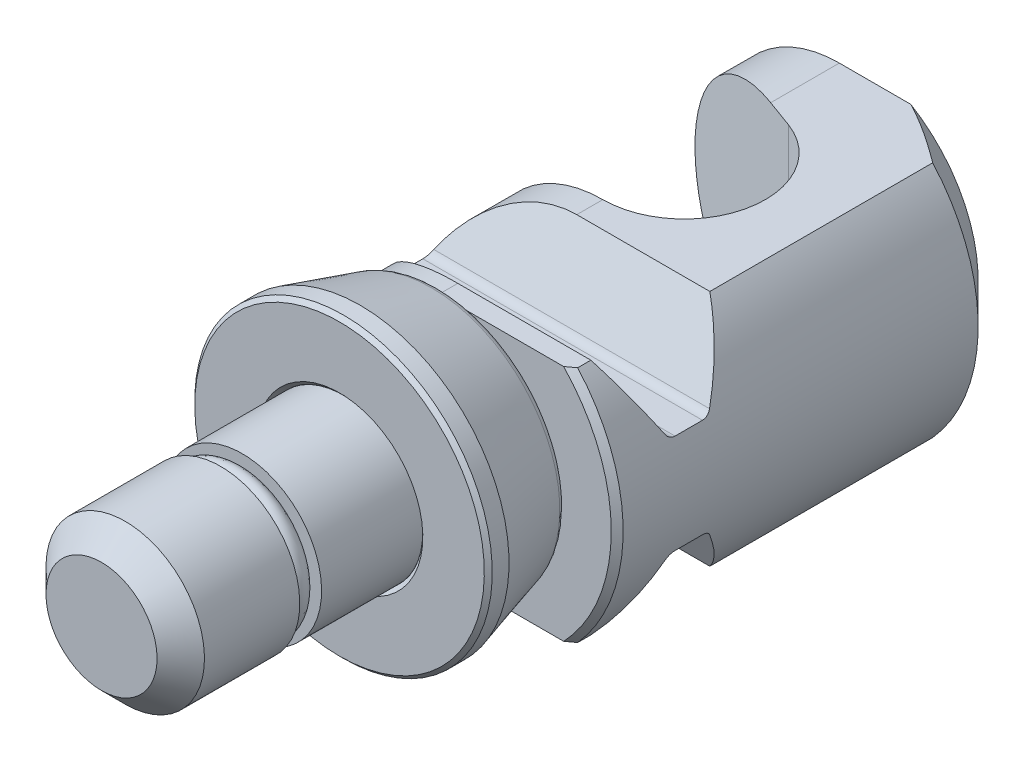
ISO-10303-21;
HEADER;
FILE_DESCRIPTION(('STEP AP214'),'2;1');
FILE_NAME('part.step','',(''),(''),'','','');
FILE_SCHEMA(('AUTOMOTIVE_DESIGN { 1 0 10303 214 1 1 1 1 }'));
ENDSEC;
DATA;
#1=APPLICATION_CONTEXT('core data for automotive mechanical design processes');
#2=APPLICATION_PROTOCOL_DEFINITION('international standard','automotive_design',2000,#1);
#3=PRODUCT_CONTEXT('',#1,'mechanical');
#4=PRODUCT('Part','Part','',(#3));
#5=PRODUCT_RELATED_PRODUCT_CATEGORY('part','',(#4));
#6=PRODUCT_DEFINITION_FORMATION('','',#4);
#7=PRODUCT_DEFINITION_CONTEXT('part definition',#1,'design');
#8=PRODUCT_DEFINITION('design','',#6,#7);
#9=PRODUCT_DEFINITION_SHAPE('','',#8);
#10=(LENGTH_UNIT() NAMED_UNIT(*) SI_UNIT(.MILLI.,.METRE.));
#11=(NAMED_UNIT(*) PLANE_ANGLE_UNIT() SI_UNIT($,.RADIAN.));
#12=(NAMED_UNIT(*) SI_UNIT($,.STERADIAN.) SOLID_ANGLE_UNIT());
#13=UNCERTAINTY_MEASURE_WITH_UNIT(LENGTH_MEASURE(1.E-05),#10,'distance_accuracy_value','');
#14=(GEOMETRIC_REPRESENTATION_CONTEXT(3) GLOBAL_UNCERTAINTY_ASSIGNED_CONTEXT((#13)) GLOBAL_UNIT_ASSIGNED_CONTEXT((#10,
#11,#12)) REPRESENTATION_CONTEXT('',''));
#15=CARTESIAN_POINT('',(0.,0.,0.));
#16=DIRECTION('',(0.,0.,1.));
#17=DIRECTION('',(1.,0.,0.));
#18=AXIS2_PLACEMENT_3D('',#15,#16,#17);
#19=CARTESIAN_POINT('',(0.,0.,-4.5));
#20=DIRECTION('',(0.,0.,-1.));
#21=DIRECTION('',(0.,1.,0.));
#22=AXIS2_PLACEMENT_3D('',#19,#20,#21);
#23=TOROIDAL_SURFACE('',#22,5.9894960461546,0.5);
#24=CARTESIAN_POINT('',(0.,0.,-5.));
#25=DIRECTION('',(0.,0.,-1.));
#26=DIRECTION('',(0.,1.,0.));
#27=AXIS2_PLACEMENT_3D('',#24,#25,#26);
#28=CIRCLE('',#27,5.9894960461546);
#29=CARTESIAN_POINT('',(0.,5.9894960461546,-5.));
#30=VERTEX_POINT('',#29);
#31=EDGE_CURVE('E10',#30,#30,#28,.T.);
#32=ORIENTED_EDGE('',*,*,#31,.F.);
#33=EDGE_LOOP('',(#32));
#34=FACE_BOUND('',#33,.T.);
#35=CARTESIAN_POINT('',(0.,0.,-4.6378186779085));
#36=DIRECTION('',(0.,0.,-1.));
#37=DIRECTION('',(0.,1.,0.));
#38=AXIS2_PLACEMENT_3D('',#35,#36,#37);
#39=CIRCLE('',#38,6.47012689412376);
#40=CARTESIAN_POINT('',(0.,6.47012689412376,-4.6378186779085));
#41=VERTEX_POINT('',#40);
#42=EDGE_CURVE('E543',#41,#41,#39,.F.);
#43=ORIENTED_EDGE('',*,*,#42,.F.);
#44=EDGE_LOOP('',(#43));
#45=FACE_BOUND('',#44,.T.);
#46=ADVANCED_FACE('F16',(#34,#45),#23,.T.);
#47=CARTESIAN_POINT('',(0.,0.,-1.0462243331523));
#48=DIRECTION('',(0.,0.,1.));
#49=DIRECTION('',(0.,-1.,0.));
#50=AXIS2_PLACEMENT_3D('',#47,#48,#49);
#51=CONICAL_SURFACE('',#50,7.5,0.279252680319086);
#52=ORIENTED_EDGE('',*,*,#42,.T.);
#53=EDGE_LOOP('',(#52));
#54=FACE_BOUND('',#53,.T.);
#55=CARTESIAN_POINT('',(0.,0.,-1.0462243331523));
#56=DIRECTION('',(0.,0.,1.));
#57=DIRECTION('',(0.,-1.,0.));
#58=AXIS2_PLACEMENT_3D('',#55,#56,#57);
#59=CIRCLE('',#58,7.5);
#60=CARTESIAN_POINT('',(0.,-7.5,-1.0462243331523));
#61=VERTEX_POINT('',#60);
#62=EDGE_CURVE('E533',#61,#61,#59,.T.);
#63=ORIENTED_EDGE('',*,*,#62,.F.);
#64=EDGE_LOOP('',(#63));
#65=FACE_BOUND('',#64,.T.);
#66=ADVANCED_FACE('F589',(#54,#65),#51,.T.);
#67=CARTESIAN_POINT('',(0.,0.,0.));
#68=DIRECTION('',(0.,0.,-1.));
#69=DIRECTION('',(0.,1.,0.));
#70=AXIS2_PLACEMENT_3D('',#67,#68,#69);
#71=CYLINDRICAL_SURFACE('',#70,7.5);
#72=CARTESIAN_POINT('',(0.,0.,-0.2));
#73=DIRECTION('',(0.,0.,1.));
#74=DIRECTION('',(0.,-1.,0.));
#75=AXIS2_PLACEMENT_3D('',#72,#73,#74);
#76=CIRCLE('',#75,7.5);
#77=CARTESIAN_POINT('',(0.,-7.5,-0.2));
#78=VERTEX_POINT('',#77);
#79=EDGE_CURVE('E536',#78,#78,#76,.F.);
#80=ORIENTED_EDGE('',*,*,#79,.T.);
#81=EDGE_LOOP('',(#80));
#82=FACE_BOUND('',#81,.T.);
#83=ORIENTED_EDGE('',*,*,#62,.T.);
#84=EDGE_LOOP('',(#83));
#85=FACE_BOUND('',#84,.T.);
#86=ADVANCED_FACE('F580',(#82,#85),#71,.T.);
#87=CARTESIAN_POINT('',(0.,0.,0.));
#88=DIRECTION('',(0.,0.,1.));
#89=DIRECTION('',(0.,-1.,0.));
#90=AXIS2_PLACEMENT_3D('',#87,#88,#89);
#91=CONICAL_SURFACE('',#90,4.2,0.785398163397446);
#92=CARTESIAN_POINT('',(0.,0.,-0.200000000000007));
#93=DIRECTION('',(0.,0.,1.));
#94=DIRECTION('',(0.,-1.,0.));
#95=AXIS2_PLACEMENT_3D('',#92,#93,#94);
#96=CIRCLE('',#95,4.);
#97=CARTESIAN_POINT('',(0.,-4.,-0.200000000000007));
#98=VERTEX_POINT('',#97);
#99=EDGE_CURVE('E549',#98,#98,#96,.T.);
#100=ORIENTED_EDGE('',*,*,#99,.F.);
#101=EDGE_LOOP('',(#100));
#102=FACE_BOUND('',#101,.T.);
#103=CARTESIAN_POINT('',(0.,0.,0.));
#104=DIRECTION('',(0.,0.,1.));
#105=DIRECTION('',(0.,-1.,0.));
#106=AXIS2_PLACEMENT_3D('',#103,#104,#105);
#107=CIRCLE('',#106,4.2);
#108=CARTESIAN_POINT('',(0.,-4.2,0.));
#109=VERTEX_POINT('',#108);
#110=EDGE_CURVE('E546',#109,#109,#107,.F.);
#111=ORIENTED_EDGE('',*,*,#110,.F.);
#112=EDGE_LOOP('',(#111));
#113=FACE_BOUND('',#112,.T.);
#114=ADVANCED_FACE('F577',(#102,#113),#91,.F.);
#115=CARTESIAN_POINT('',(4.,0.,0.));
#116=DIRECTION('',(0.,0.,1.));
#117=DIRECTION('',(0.,-1.,0.));
#118=AXIS2_PLACEMENT_3D('',#115,#116,#117);
#119=PLANE('',#118);
#120=ORIENTED_EDGE('',*,*,#110,.T.);
#121=EDGE_LOOP('',(#120));
#122=FACE_BOUND('',#121,.T.);
#123=CARTESIAN_POINT('',(0.,0.,0.));
#124=DIRECTION('',(0.,0.,1.));
#125=DIRECTION('',(0.,-1.,0.));
#126=AXIS2_PLACEMENT_3D('',#123,#124,#125);
#127=CIRCLE('',#126,7.3);
#128=CARTESIAN_POINT('',(0.,-7.3,0.));
#129=VERTEX_POINT('',#128);
#130=EDGE_CURVE('E540',#129,#129,#127,.T.);
#131=ORIENTED_EDGE('',*,*,#130,.T.);
#132=EDGE_LOOP('',(#131));
#133=FACE_BOUND('',#132,.T.);
#134=ADVANCED_FACE('F579',(#122,#133),#119,.T.);
#135=CARTESIAN_POINT('',(0.,0.,-0.2));
#136=DIRECTION('',(0.,0.,-1.));
#137=DIRECTION('',(0.,1.,0.));
#138=AXIS2_PLACEMENT_3D('',#135,#136,#137);
#139=CONICAL_SURFACE('',#138,7.5,0.785398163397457);
#140=ORIENTED_EDGE('',*,*,#130,.F.);
#141=EDGE_LOOP('',(#140));
#142=FACE_BOUND('',#141,.T.);
#143=ORIENTED_EDGE('',*,*,#79,.F.);
#144=EDGE_LOOP('',(#143));
#145=FACE_BOUND('',#144,.T.);
#146=ADVANCED_FACE('F586',(#142,#145),#139,.T.);
#147=CARTESIAN_POINT('',(0.,0.,-5.));
#148=DIRECTION('',(0.,0.,1.));
#149=DIRECTION('',(0.,1.,0.));
#150=AXIS2_PLACEMENT_3D('',#147,#148,#149);
#151=PLANE('',#150);
#152=ORIENTED_EDGE('',*,*,#31,.T.);
#153=EDGE_LOOP('',(#152));
#154=FACE_BOUND('',#153,.T.);
#155=DIRECTION('',(-1.,0.,0.));
#156=VECTOR('',#155,1.);
#157=CARTESIAN_POINT('',(0.,-6.,-5.));
#158=LINE('',#157,#156);
#159=CARTESIAN_POINT('',(6.3,-6.,-5.));
#160=VERTEX_POINT('',#159);
#161=CARTESIAN_POINT('',(0.,-6.,-5.));
#162=VERTEX_POINT('',#161);
#163=EDGE_CURVE('E318',#160,#162,#158,.T.);
#164=ORIENTED_EDGE('',*,*,#163,.F.);
#165=CARTESIAN_POINT('',(0.,0.,-5.));
#166=DIRECTION('',(0.,0.,1.));
#167=DIRECTION('',(0.,1.,0.));
#168=AXIS2_PLACEMENT_3D('',#165,#166,#167);
#169=CIRCLE('',#168,8.7);
#170=CARTESIAN_POINT('',(6.3,6.,-5.));
#171=VERTEX_POINT('',#170);
#172=EDGE_CURVE('E491',#160,#171,#169,.T.);
#173=ORIENTED_EDGE('',*,*,#172,.T.);
#174=DIRECTION('',(1.,0.,0.));
#175=VECTOR('',#174,1.);
#176=CARTESIAN_POINT('',(0.,6.,-5.));
#177=LINE('',#176,#175);
#178=CARTESIAN_POINT('',(0.,6.,-5.));
#179=VERTEX_POINT('',#178);
#180=EDGE_CURVE('E320',#179,#171,#177,.T.);
#181=ORIENTED_EDGE('',*,*,#180,.F.);
#182=CARTESIAN_POINT('',(0.,0.,-5.));
#183=DIRECTION('',(0.,0.,-1.));
#184=DIRECTION('',(0.,1.,0.));
#185=AXIS2_PLACEMENT_3D('',#182,#183,#184);
#186=CIRCLE('',#185,6.);
#187=EDGE_CURVE('E288',#162,#179,#186,.T.);
#188=ORIENTED_EDGE('',*,*,#187,.F.);
#189=EDGE_LOOP('',(#164,#173,#181,#188));
#190=FACE_BOUND('',#189,.T.);
#191=ADVANCED_FACE('F434',(#154,#190),#151,.T.);
#192=CARTESIAN_POINT('',(10.,-6.,-25.5));
#193=DIRECTION('',(0.,1.,0.));
#194=DIRECTION('',(-1.,0.,0.));
#195=AXIS2_PLACEMENT_3D('',#192,#193,#194);
#196=PLANE('',#195);
#197=DIRECTION('',(0.,0.,-1.));
#198=VECTOR('',#197,1.);
#199=CARTESIAN_POINT('',(6.70820393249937,-6.,-5.));
#200=LINE('',#199,#198);
#201=CARTESIAN_POINT('',(6.70820393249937,-6.,-5.96271324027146));
#202=VERTEX_POINT('',#201);
#203=CARTESIAN_POINT('',(6.70820393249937,-6.,-5.3));
#204=VERTEX_POINT('',#203);
#205=EDGE_CURVE('E312',#202,#204,#200,.F.);
#206=ORIENTED_EDGE('',*,*,#205,.T.);
#207=CARTESIAN_POINT('',(6.70820393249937,-6.,-5.3));
#208=CARTESIAN_POINT('',(6.6405142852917,-6.,-5.24953149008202));
#209=CARTESIAN_POINT('',(6.57265247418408,-6.,-5.19929724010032));
#210=CARTESIAN_POINT('',(6.4365844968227,-6.,-5.099297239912));
#211=CARTESIAN_POINT('',(6.36837833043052,-6.,-5.04953148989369));
#212=CARTESIAN_POINT('',(6.3,-6.,-5.));
#213=B_SPLINE_CURVE_WITH_KNOTS('',3,(#207,#208,#209,#210,#211,#212),.UNSPECIFIED.,.F.,.F.,(4,2,
4),(0.,0.253294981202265,0.50659006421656),.UNSPECIFIED.);
#214=EDGE_CURVE('E477',#204,#160,#213,.T.);
#215=ORIENTED_EDGE('',*,*,#214,.T.);
#216=ORIENTED_EDGE('',*,*,#163,.T.);
#217=DIRECTION('',(0.,0.,1.));
#218=VECTOR('',#217,1.);
#219=CARTESIAN_POINT('',(0.,-6.,-25.2));
#220=LINE('',#219,#218);
#221=CARTESIAN_POINT('',(0.,-6.,-5.96271324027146));
#222=VERTEX_POINT('',#221);
#223=EDGE_CURVE('E292',#222,#162,#220,.T.);
#224=ORIENTED_EDGE('',*,*,#223,.F.);
#225=DIRECTION('',(1.,0.,0.));
#226=VECTOR('',#225,1.);
#227=CARTESIAN_POINT('',(10.,-6.,-5.96271324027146));
#228=LINE('',#227,#226);
#229=EDGE_CURVE('E335',#222,#202,#228,.T.);
#230=ORIENTED_EDGE('',*,*,#229,.T.);
#231=EDGE_LOOP('',(#206,#215,#216,#224,#230));
#232=FACE_BOUND('',#231,.T.);
#233=ADVANCED_FACE('F471',(#232),#196,.F.);
#234=CARTESIAN_POINT('',(0.,0.,-5.3));
#235=DIRECTION('',(0.,0.,-1.));
#236=DIRECTION('',(0.,-1.,0.));
#237=AXIS2_PLACEMENT_3D('',#234,#235,#236);
#238=CONICAL_SURFACE('',#237,9.,0.785398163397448);
#239=CARTESIAN_POINT('',(6.3,6.,-5.));
#240=CARTESIAN_POINT('',(6.36837833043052,6.,-5.0495314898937));
#241=CARTESIAN_POINT('',(6.4365844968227,6.00000000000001,-5.099297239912));
#242=CARTESIAN_POINT('',(6.57265247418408,6.00000000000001,-5.19929724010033));
#243=CARTESIAN_POINT('',(6.64051428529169,6.,-5.24953149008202));
#244=CARTESIAN_POINT('',(6.70820393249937,6.,-5.3));
#245=B_SPLINE_CURVE_WITH_KNOTS('',3,(#239,#240,#241,#242,#243,#244),.UNSPECIFIED.,.F.,.F.,(4,2,
4),(0.,0.253295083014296,0.50659006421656),.UNSPECIFIED.);
#246=CARTESIAN_POINT('',(6.70820393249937,6.,-5.3));
#247=VERTEX_POINT('',#246);
#248=EDGE_CURVE('E484',#171,#247,#245,.T.);
#249=ORIENTED_EDGE('',*,*,#248,.F.);
#250=ORIENTED_EDGE('',*,*,#172,.F.);
#251=ORIENTED_EDGE('',*,*,#214,.F.);
#252=CARTESIAN_POINT('',(0.,0.,-5.3));
#253=DIRECTION('',(0.,0.,1.));
#254=DIRECTION('',(0.,1.,0.));
#255=AXIS2_PLACEMENT_3D('',#252,#253,#254);
#256=CIRCLE('',#255,9.);
#257=EDGE_CURVE('E722',#247,#204,#256,.F.);
#258=ORIENTED_EDGE('',*,*,#257,.F.);
#259=EDGE_LOOP('',(#249,#250,#251,#258));
#260=FACE_BOUND('',#259,.T.);
#261=ADVANCED_FACE('F465',(#260),#238,.T.);
#262=CARTESIAN_POINT('',(10.,6.,-25.5));
#263=DIRECTION('',(0.,-1.,0.));
#264=DIRECTION('',(0.,0.,1.));
#265=AXIS2_PLACEMENT_3D('',#262,#263,#264);
#266=PLANE('',#265);
#267=ORIENTED_EDGE('',*,*,#180,.T.);
#268=ORIENTED_EDGE('',*,*,#248,.T.);
#269=DIRECTION('',(0.,0.,-1.));
#270=VECTOR('',#269,1.);
#271=CARTESIAN_POINT('',(6.70820393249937,6.,-5.));
#272=LINE('',#271,#270);
#273=CARTESIAN_POINT('',(6.70820393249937,6.,-5.96271324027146));
#274=VERTEX_POINT('',#273);
#275=EDGE_CURVE('E305',#247,#274,#272,.T.);
#276=ORIENTED_EDGE('',*,*,#275,.T.);
#277=DIRECTION('',(-1.,0.,0.));
#278=VECTOR('',#277,1.);
#279=CARTESIAN_POINT('',(15.,6.,-5.96271324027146));
#280=LINE('',#279,#278);
#281=CARTESIAN_POINT('',(0.,6.,-5.96271324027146));
#282=VERTEX_POINT('',#281);
#283=EDGE_CURVE('E250',#274,#282,#280,.T.);
#284=ORIENTED_EDGE('',*,*,#283,.T.);
#285=DIRECTION('',(0.,0.,1.));
#286=VECTOR('',#285,1.);
#287=CARTESIAN_POINT('',(0.,6.,-25.2));
#288=LINE('',#287,#286);
#289=EDGE_CURVE('E300',#282,#179,#288,.T.);
#290=ORIENTED_EDGE('',*,*,#289,.T.);
#291=EDGE_LOOP('',(#267,#268,#276,#284,#290));
#292=FACE_BOUND('',#291,.T.);
#293=ADVANCED_FACE('F470',(#292),#266,.F.);
#294=CARTESIAN_POINT('',(0.,0.,-25.2));
#295=DIRECTION('',(0.,0.,1.));
#296=DIRECTION('',(0.,1.,0.));
#297=AXIS2_PLACEMENT_3D('',#294,#295,#296);
#298=CYLINDRICAL_SURFACE('',#297,6.);
#299=CARTESIAN_POINT('',(0.,0.,-8.49861162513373));
#300=DIRECTION('',(0.,0.5,0.86602540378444));
#301=DIRECTION('',(0.,-0.866025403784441,0.5));
#302=AXIS2_PLACEMENT_3D('',#299,#300,#301);
#303=ELLIPSE('',#302,6.9282032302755,6.);
#304=CARTESIAN_POINT('',(0.,6.,-11.9627132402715));
#305=VERTEX_POINT('',#304);
#306=CARTESIAN_POINT('',(-5.33268225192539,2.75,-10.0863248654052));
#307=VERTEX_POINT('',#306);
#308=EDGE_CURVE('E254',#305,#307,#303,.T.);
#309=ORIENTED_EDGE('',*,*,#308,.F.);
#310=CARTESIAN_POINT('',(0.,6.,-13.275));
#311=VERTEX_POINT('',#310);
#312=EDGE_CURVE('E299',#311,#305,#288,.T.);
#313=ORIENTED_EDGE('',*,*,#312,.F.);
#314=CARTESIAN_POINT('',(0.,0.,-13.275));
#315=DIRECTION('',(0.,0.,1.));
#316=DIRECTION('',(0.,1.,0.));
#317=AXIS2_PLACEMENT_3D('',#314,#315,#316);
#318=CIRCLE('',#317,6.);
#319=CARTESIAN_POINT('',(0.,-6.,-13.275));
#320=VERTEX_POINT('',#319);
#321=EDGE_CURVE('E326',#311,#320,#318,.T.);
#322=ORIENTED_EDGE('',*,*,#321,.T.);
#323=CARTESIAN_POINT('',(0.,-6.,-11.9627132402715));
#324=VERTEX_POINT('',#323);
#325=EDGE_CURVE('E304',#320,#324,#220,.T.);
#326=ORIENTED_EDGE('',*,*,#325,.T.);
#327=CARTESIAN_POINT('',(0.,0.,-8.49861162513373));
#328=DIRECTION('',(0.,0.5,-0.86602540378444));
#329=DIRECTION('',(0.,0.866025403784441,0.5));
#330=AXIS2_PLACEMENT_3D('',#327,#328,#329);
#331=ELLIPSE('',#330,6.9282032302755,6.);
#332=CARTESIAN_POINT('',(-5.33268225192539,-2.75,-10.0863248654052));
#333=VERTEX_POINT('',#332);
#334=EDGE_CURVE('E263',#324,#333,#331,.T.);
#335=ORIENTED_EDGE('',*,*,#334,.T.);
#336=CARTESIAN_POINT('',(-5.33268225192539,-2.75,-10.0863248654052));
#337=CARTESIAN_POINT('',(-5.34475324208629,-2.7266029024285,-10.0728451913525));
#338=CARTESIAN_POINT('',(-5.35618869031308,-2.70403892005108,-10.0572626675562));
#339=CARTESIAN_POINT('',(-5.37755487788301,-2.66128948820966,-10.022143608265));
#340=CARTESIAN_POINT('',(-5.38748089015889,-2.64111155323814,-10.002595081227));
#341=CARTESIAN_POINT('',(-5.40554463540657,-2.60394326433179,-9.95981715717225));
#342=CARTESIAN_POINT('',(-5.4136768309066,-2.58696280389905,-9.93657673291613));
#343=CARTESIAN_POINT('',(-5.42786315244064,-2.55706390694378,-9.88706764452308));
#344=CARTESIAN_POINT('',(-5.43391962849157,-2.54414087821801,-9.8608024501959));
#345=CARTESIAN_POINT('',(-5.443411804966,-2.523764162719,-9.80804187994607));
#346=CARTESIAN_POINT('',(-5.44700580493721,-2.51598161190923,-9.78170154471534));
#347=CARTESIAN_POINT('',(-5.45213658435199,-2.504844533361,-9.72794637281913));
#348=CARTESIAN_POINT('',(-5.45367835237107,-2.50147926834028,-9.70053430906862));
#349=CARTESIAN_POINT('',(-5.45429677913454,-2.50012911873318,-9.66647580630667));
#350=CARTESIAN_POINT('',(-5.45435646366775,-2.49999877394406,-9.65989246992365));
#351=CARTESIAN_POINT('',(-5.45435605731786,-2.5,-9.65331216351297));
#352=B_SPLINE_CURVE_WITH_KNOTS('',3,(#336,#337,#338,#339,#340,#341,#342,#343,#344,#345,#346,
#347,#348,#349,#350,#351),.UNSPECIFIED.,.F.,.F.,(4,2,2,2,2,2,2,4),(0.,0.0887050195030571,
0.17768235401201,0.266930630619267,0.356077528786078,0.438754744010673,0.521230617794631,
0.540978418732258),.UNSPECIFIED.);
#353=CARTESIAN_POINT('',(-5.45435605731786,-2.5,-9.65331216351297));
#354=VERTEX_POINT('',#353);
#355=EDGE_CURVE('E370',#333,#354,#352,.T.);
#356=ORIENTED_EDGE('',*,*,#355,.T.);
#357=DIRECTION('',(0.,0.,1.));
#358=VECTOR('',#357,1.);
#359=CARTESIAN_POINT('',(-5.45435605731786,-2.5,-25.2));
#360=LINE('',#359,#358);
#361=CARTESIAN_POINT('',(-5.45435605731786,-2.5,-8.27211431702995));
#362=VERTEX_POINT('',#361);
#363=EDGE_CURVE('E270',#354,#362,#360,.T.);
#364=ORIENTED_EDGE('',*,*,#363,.T.);
#365=CARTESIAN_POINT('',(-5.45435605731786,-2.5,-8.27211431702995));
#366=CARTESIAN_POINT('',(-5.45436490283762,-2.4999688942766,-8.2459340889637));
#367=CARTESIAN_POINT('',(-5.45341453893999,-2.50205408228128,-8.21977283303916));
#368=CARTESIAN_POINT('',(-5.44966589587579,-2.51021455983,-8.16829299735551));
#369=CARTESIAN_POINT('',(-5.44687308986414,-2.5162780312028,-8.14297215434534));
#370=CARTESIAN_POINT('',(-5.43951038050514,-2.53215290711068,-8.09382141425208));
#371=CARTESIAN_POINT('',(-5.43494098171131,-2.54196324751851,-8.0699910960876));
#372=CARTESIAN_POINT('',(-5.4241421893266,-2.56492550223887,-8.02440168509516));
#373=CARTESIAN_POINT('',(-5.41791194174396,-2.57807913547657,-8.00264366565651));
#374=CARTESIAN_POINT('',(-5.4037204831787,-2.60769678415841,-7.96103367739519));
#375=CARTESIAN_POINT('',(-5.39571089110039,-2.6242520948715,-7.94126343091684));
#376=CARTESIAN_POINT('',(-5.37827561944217,-2.65980076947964,-7.9048107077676));
#377=CARTESIAN_POINT('',(-5.36885043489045,-2.67879328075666,-7.88812715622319));
#378=CARTESIAN_POINT('',(-5.35050377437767,-2.71522718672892,-7.86061048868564));
#379=CARTESIAN_POINT('',(-5.34177183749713,-2.73237833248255,-7.84926478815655));
#380=CARTESIAN_POINT('',(-5.3326822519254,-2.75,-7.8391016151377));
#381=B_SPLINE_CURVE_WITH_KNOTS('',3,(#365,#366,#367,#368,#369,#370,#371,#372,#373,#374,#375,
#376,#377,#378,#379,#380),.UNSPECIFIED.,.F.,.F.,(4,2,2,2,2,2,2,4),(0.,0.0784111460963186,
0.156590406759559,0.234747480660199,0.312944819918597,0.393607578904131,0.474242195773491,
0.541086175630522),.UNSPECIFIED.);
#382=CARTESIAN_POINT('',(-5.33268225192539,-2.75,-7.83910161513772));
#383=VERTEX_POINT('',#382);
#384=EDGE_CURVE('E409',#362,#383,#381,.T.);
#385=ORIENTED_EDGE('',*,*,#384,.T.);
#386=CARTESIAN_POINT('',(0.,0.,-9.42681485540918));
#387=DIRECTION('',(0.,0.5,0.86602540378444));
#388=DIRECTION('',(0.,-0.866025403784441,0.5));
#389=AXIS2_PLACEMENT_3D('',#386,#387,#388);
#390=ELLIPSE('',#389,6.9282032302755,6.);
#391=EDGE_CURVE('E268',#383,#222,#390,.T.);
#392=ORIENTED_EDGE('',*,*,#391,.T.);
#393=ORIENTED_EDGE('',*,*,#223,.T.);
#394=ORIENTED_EDGE('',*,*,#187,.T.);
#395=ORIENTED_EDGE('',*,*,#289,.F.);
#396=CARTESIAN_POINT('',(0.,0.,-9.42681485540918));
#397=DIRECTION('',(0.,0.5,-0.86602540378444));
#398=DIRECTION('',(0.,0.866025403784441,0.5));
#399=AXIS2_PLACEMENT_3D('',#396,#397,#398);
#400=ELLIPSE('',#399,6.9282032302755,6.);
#401=CARTESIAN_POINT('',(-5.33268225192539,2.75,-7.83910161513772));
#402=VERTEX_POINT('',#401);
#403=EDGE_CURVE('E249',#402,#282,#400,.T.);
#404=ORIENTED_EDGE('',*,*,#403,.F.);
#405=CARTESIAN_POINT('',(-5.33268225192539,2.75,-7.83910161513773));
#406=CARTESIAN_POINT('',(-5.34475324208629,2.72660290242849,-7.8525812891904));
#407=CARTESIAN_POINT('',(-5.35618869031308,2.70403892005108,-7.86816381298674));
#408=CARTESIAN_POINT('',(-5.37755487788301,2.66128948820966,-7.90328287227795));
#409=CARTESIAN_POINT('',(-5.38748089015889,2.64111155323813,-7.92283139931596));
#410=CARTESIAN_POINT('',(-5.40554463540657,2.60394326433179,-7.96560932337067));
#411=CARTESIAN_POINT('',(-5.4136768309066,2.58696280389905,-7.98884974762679));
#412=CARTESIAN_POINT('',(-5.42786315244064,2.55706390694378,-8.03835883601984));
#413=CARTESIAN_POINT('',(-5.43391962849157,2.544140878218,-8.06462403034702));
#414=CARTESIAN_POINT('',(-5.443411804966,2.52376416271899,-8.11738460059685));
#415=CARTESIAN_POINT('',(-5.44700580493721,2.51598161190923,-8.14372493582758));
#416=CARTESIAN_POINT('',(-5.45213658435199,2.504844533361,-8.19748010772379));
#417=CARTESIAN_POINT('',(-5.45367835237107,2.50147926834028,-8.22489217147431));
#418=CARTESIAN_POINT('',(-5.45429677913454,2.50012911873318,-8.25895067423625));
#419=CARTESIAN_POINT('',(-5.45435646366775,2.49999877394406,-8.26553401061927));
#420=CARTESIAN_POINT('',(-5.45435605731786,2.5,-8.27211431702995));
#421=B_SPLINE_CURVE_WITH_KNOTS('',3,(#405,#406,#407,#408,#409,#410,#411,#412,#413,#414,#415,
#416,#417,#418,#419,#420),.UNSPECIFIED.,.F.,.F.,(4,2,2,2,2,2,2,4),(0.,0.0887050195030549,
0.177682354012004,0.266930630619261,0.356077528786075,0.438754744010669,0.521230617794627,
0.540978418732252),.UNSPECIFIED.);
#422=CARTESIAN_POINT('',(-5.45435605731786,2.5,-8.27211431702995));
#423=VERTEX_POINT('',#422);
#424=EDGE_CURVE('E421',#402,#423,#421,.T.);
#425=ORIENTED_EDGE('',*,*,#424,.T.);
#426=DIRECTION('',(0.,0.,1.));
#427=VECTOR('',#426,1.);
#428=CARTESIAN_POINT('',(-5.45435605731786,2.5,-25.2));
#429=LINE('',#428,#427);
#430=CARTESIAN_POINT('',(-5.45435605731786,2.5,-9.65331216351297));
#431=VERTEX_POINT('',#430);
#432=EDGE_CURVE('E257',#431,#423,#429,.T.);
#433=ORIENTED_EDGE('',*,*,#432,.F.);
#434=CARTESIAN_POINT('',(-5.45435605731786,2.5,-9.65331216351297));
#435=CARTESIAN_POINT('',(-5.45436490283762,2.4999688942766,-9.67949239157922));
#436=CARTESIAN_POINT('',(-5.45341453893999,2.50205408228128,-9.70565364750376));
#437=CARTESIAN_POINT('',(-5.44966589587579,2.51021455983,-9.7571334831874));
#438=CARTESIAN_POINT('',(-5.44687308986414,2.5162780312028,-9.78245432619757));
#439=CARTESIAN_POINT('',(-5.43951038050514,2.53215290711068,-9.83160506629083));
#440=CARTESIAN_POINT('',(-5.43494098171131,2.54196324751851,-9.85543538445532));
#441=CARTESIAN_POINT('',(-5.4241421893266,2.56492550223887,-9.90102479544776));
#442=CARTESIAN_POINT('',(-5.41791194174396,2.57807913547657,-9.92278281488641));
#443=CARTESIAN_POINT('',(-5.4037204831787,2.60769678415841,-9.96439280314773));
#444=CARTESIAN_POINT('',(-5.39571089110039,2.6242520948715,-9.98416304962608));
#445=CARTESIAN_POINT('',(-5.37827561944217,2.65980076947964,-10.0206157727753));
#446=CARTESIAN_POINT('',(-5.36885043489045,2.67879328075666,-10.0372993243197));
#447=CARTESIAN_POINT('',(-5.35050377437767,2.71522718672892,-10.0648159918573));
#448=CARTESIAN_POINT('',(-5.34177183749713,2.73237833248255,-10.0761616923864));
#449=CARTESIAN_POINT('',(-5.3326822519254,2.75,-10.0863248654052));
#450=B_SPLINE_CURVE_WITH_KNOTS('',3,(#434,#435,#436,#437,#438,#439,#440,#441,#442,#443,#444,
#445,#446,#447,#448,#449),.UNSPECIFIED.,.F.,.F.,(4,2,2,2,2,2,2,4),(0.,0.0784111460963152,
0.15659040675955,0.234747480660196,0.312944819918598,0.393607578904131,0.474242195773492,
0.541086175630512),.UNSPECIFIED.);
#451=EDGE_CURVE('E447',#431,#307,#450,.T.);
#452=ORIENTED_EDGE('',*,*,#451,.T.);
#453=EDGE_LOOP('',(#309,#313,#322,#326,#335,#356,#364,#385,#392,#393,#394,#395,#404,#425,#433,#452));
#454=FACE_BOUND('',#453,.T.);
#455=ADVANCED_FACE('F433',(#454),#298,.T.);
#456=CARTESIAN_POINT('',(0.,0.,-5.));
#457=DIRECTION('',(0.,0.,-1.));
#458=DIRECTION('',(0.,-1.,0.));
#459=AXIS2_PLACEMENT_3D('',#456,#457,#458);
#460=CYLINDRICAL_SURFACE('',#459,9.);
#461=CARTESIAN_POINT('',(6.70820393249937,-6.,-23.2));
#462=VERTEX_POINT('',#461);
#463=CARTESIAN_POINT('',(6.70820393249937,-6.,-11.9627132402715));
#464=VERTEX_POINT('',#463);
#465=EDGE_CURVE('E313',#462,#464,#200,.F.);
#466=ORIENTED_EDGE('',*,*,#465,.F.);
#467=CARTESIAN_POINT('',(0.,0.,-23.2));
#468=DIRECTION('',(0.,0.,-1.));
#469=DIRECTION('',(0.,-1.,0.));
#470=AXIS2_PLACEMENT_3D('',#467,#468,#469);
#471=CIRCLE('',#470,9.);
#472=CARTESIAN_POINT('',(6.70820393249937,6.,-23.2));
#473=VERTEX_POINT('',#472);
#474=EDGE_CURVE('E42',#462,#473,#471,.F.);
#475=ORIENTED_EDGE('',*,*,#474,.T.);
#476=CARTESIAN_POINT('',(6.70820393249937,6.,-11.9627132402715));
#477=VERTEX_POINT('',#476);
#478=EDGE_CURVE('E298',#477,#473,#272,.T.);
#479=ORIENTED_EDGE('',*,*,#478,.F.);
#480=CARTESIAN_POINT('',(0.,0.,-8.49861162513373));
#481=DIRECTION('',(0.,0.5,0.86602540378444));
#482=DIRECTION('',(0.,0.866025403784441,-0.5));
#483=AXIS2_PLACEMENT_3D('',#480,#481,#482);
#484=ELLIPSE('',#483,10.3923048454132,9.);
#485=CARTESIAN_POINT('',(8.56956825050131,2.75,-10.0863248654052));
#486=VERTEX_POINT('',#485);
#487=EDGE_CURVE('E347',#477,#486,#484,.F.);
#488=ORIENTED_EDGE('',*,*,#487,.T.);
#489=CARTESIAN_POINT('',(8.56956825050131,2.75,-10.0863248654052));
#490=CARTESIAN_POINT('',(8.57724769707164,2.72607635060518,-10.072541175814));
#491=CARTESIAN_POINT('',(8.58447567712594,2.70320069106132,-10.0566648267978));
#492=CARTESIAN_POINT('',(8.59789140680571,2.66021812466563,-10.0211691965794));
#493=CARTESIAN_POINT('',(8.60407914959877,2.64011123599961,-10.0015498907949));
#494=CARTESIAN_POINT('',(8.61528842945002,2.60330179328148,-9.95896751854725));
#495=CARTESIAN_POINT('',(8.62030756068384,2.58660627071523,-9.93599770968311));
#496=CARTESIAN_POINT('',(8.62905411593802,2.55727570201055,-9.88740696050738));
#497=CARTESIAN_POINT('',(8.63278261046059,2.54463729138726,-9.86178824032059));
#498=CARTESIAN_POINT('',(8.63912061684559,2.52304068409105,-9.80647191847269));
#499=CARTESIAN_POINT('',(8.64161686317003,2.51445740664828,-9.7766119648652));
#500=CARTESIAN_POINT('',(8.6441257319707,2.50581290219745,-9.73091866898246));
#501=CARTESIAN_POINT('',(8.64475612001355,2.50363636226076,-9.71548867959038));
#502=CARTESIAN_POINT('',(8.64559725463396,2.50072974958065,-9.68447995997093));
#503=CARTESIAN_POINT('',(8.64580795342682,2.49999984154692,-9.6689012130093));
#504=CARTESIAN_POINT('',(8.64580823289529,2.5,-9.65331216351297));
#505=B_SPLINE_CURVE_WITH_KNOTS('',3,(#489,#490,#491,#492,#493,#494,#495,#496,#497,#498,#499,
#500,#501,#502,#503,#504),.UNSPECIFIED.,.F.,.F.,(4,2,2,2,2,2,2,4),(0.,0.085897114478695,
0.171794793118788,0.257867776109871,0.343869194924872,0.436744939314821,0.483467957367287,
0.530196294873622),.UNSPECIFIED.);
#506=CARTESIAN_POINT('',(8.6458082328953,2.5,-9.65331216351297));
#507=VERTEX_POINT('',#506);
#508=EDGE_CURVE('E452',#486,#507,#505,.T.);
#509=ORIENTED_EDGE('',*,*,#508,.T.);
#510=DIRECTION('',(0.,0.,-1.));
#511=VECTOR('',#510,1.);
#512=CARTESIAN_POINT('',(8.6458082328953,2.5,-5.));
#513=LINE('',#512,#511);
#514=CARTESIAN_POINT('',(8.6458082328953,2.5,-8.27211431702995));
#515=VERTEX_POINT('',#514);
#516=EDGE_CURVE('E344',#507,#515,#513,.F.);
#517=ORIENTED_EDGE('',*,*,#516,.T.);
#518=CARTESIAN_POINT('',(8.6458082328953,2.5,-8.27211431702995));
#519=CARTESIAN_POINT('',(8.6458125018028,2.49997249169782,-8.24483001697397));
#520=CARTESIAN_POINT('',(8.64516293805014,2.50223148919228,-8.21755808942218));
#521=CARTESIAN_POINT('',(8.64258935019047,2.51111277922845,-8.16385009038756));
#522=CARTESIAN_POINT('',(8.64066786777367,2.51772636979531,-8.13741246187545));
#523=CARTESIAN_POINT('',(8.63558319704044,2.53510938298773,-8.086067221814));
#524=CARTESIAN_POINT('',(8.63241990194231,2.5458791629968,-8.06115974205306));
#525=CARTESIAN_POINT('',(8.62491001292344,2.5712063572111,-8.01353505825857));
#526=CARTESIAN_POINT('',(8.62056284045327,2.58576562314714,-7.99081893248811));
#527=CARTESIAN_POINT('',(8.61069465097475,2.6184408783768,-7.94784146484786));
#528=CARTESIAN_POINT('',(8.60515689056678,2.63660728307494,-7.92762239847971));
#529=CARTESIAN_POINT('',(8.59306244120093,2.67576053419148,-7.89054701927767));
#530=CARTESIAN_POINT('',(8.586507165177,2.69674346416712,-7.87368611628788));
#531=CARTESIAN_POINT('',(8.57628879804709,2.72899008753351,-7.85174962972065));
#532=CARTESIAN_POINT('',(8.57297160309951,2.73939542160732,-7.84522072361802));
#533=CARTESIAN_POINT('',(8.56956825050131,2.75,-7.83910161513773));
#534=B_SPLINE_CURVE_WITH_KNOTS('',3,(#518,#519,#520,#521,#522,#523,#524,#525,#526,#527,#528,
#529,#530,#531,#532,#533),.UNSPECIFIED.,.F.,.F.,(4,2,2,2,2,2,2,4),(0.,0.0817331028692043,
0.163303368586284,0.244880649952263,0.326497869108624,0.409348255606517,0.492084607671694,
0.530219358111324),.UNSPECIFIED.);
#535=CARTESIAN_POINT('',(8.56956825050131,2.75,-7.83910161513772));
#536=VERTEX_POINT('',#535);
#537=EDGE_CURVE('E441',#515,#536,#534,.T.);
#538=ORIENTED_EDGE('',*,*,#537,.T.);
#539=CARTESIAN_POINT('',(0.,0.,-9.42681485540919));
#540=DIRECTION('',(0.,0.5,-0.86602540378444));
#541=DIRECTION('',(0.,-0.866025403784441,-0.5));
#542=AXIS2_PLACEMENT_3D('',#539,#540,#541);
#543=ELLIPSE('',#542,10.3923048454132,9.);
#544=EDGE_CURVE('E341',#536,#274,#543,.F.);
#545=ORIENTED_EDGE('',*,*,#544,.T.);
#546=ORIENTED_EDGE('',*,*,#275,.F.);
#547=ORIENTED_EDGE('',*,*,#257,.T.);
#548=ORIENTED_EDGE('',*,*,#205,.F.);
#549=CARTESIAN_POINT('',(0.,0.,-9.42681485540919));
#550=DIRECTION('',(0.,0.5,0.86602540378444));
#551=DIRECTION('',(0.,0.866025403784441,-0.5));
#552=AXIS2_PLACEMENT_3D('',#549,#550,#551);
#553=ELLIPSE('',#552,10.3923048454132,9.);
#554=CARTESIAN_POINT('',(8.56956825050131,-2.75,-7.83910161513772));
#555=VERTEX_POINT('',#554);
#556=EDGE_CURVE('E266',#555,#202,#553,.F.);
#557=ORIENTED_EDGE('',*,*,#556,.F.);
#558=CARTESIAN_POINT('',(8.56956825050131,-2.75,-7.83910161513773));
#559=CARTESIAN_POINT('',(8.57724769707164,-2.72607635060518,-7.85288530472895));
#560=CARTESIAN_POINT('',(8.58447567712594,-2.70320069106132,-7.86876165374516));
#561=CARTESIAN_POINT('',(8.59789140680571,-2.66021812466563,-7.90425728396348));
#562=CARTESIAN_POINT('',(8.60407914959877,-2.6401112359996,-7.92387658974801));
#563=CARTESIAN_POINT('',(8.61528842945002,-2.60330179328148,-7.96645896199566));
#564=CARTESIAN_POINT('',(8.62030756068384,-2.58660627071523,-7.9894287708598));
#565=CARTESIAN_POINT('',(8.62905411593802,-2.55727570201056,-8.03801952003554));
#566=CARTESIAN_POINT('',(8.63278261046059,-2.54463729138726,-8.06363824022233));
#567=CARTESIAN_POINT('',(8.63912061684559,-2.52304068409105,-8.11895456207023));
#568=CARTESIAN_POINT('',(8.64161686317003,-2.51445740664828,-8.14881451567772));
#569=CARTESIAN_POINT('',(8.6441257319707,-2.50581290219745,-8.19450781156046));
#570=CARTESIAN_POINT('',(8.64475612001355,-2.50363636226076,-8.20993780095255));
#571=CARTESIAN_POINT('',(8.64559725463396,-2.50072974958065,-8.24094652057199));
#572=CARTESIAN_POINT('',(8.64580795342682,-2.49999984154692,-8.25652526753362));
#573=CARTESIAN_POINT('',(8.64580823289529,-2.5,-8.27211431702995));
#574=B_SPLINE_CURVE_WITH_KNOTS('',3,(#558,#559,#560,#561,#562,#563,#564,#565,#566,#567,#568,
#569,#570,#571,#572,#573),.UNSPECIFIED.,.F.,.F.,(4,2,2,2,2,2,2,4),(0.,0.0858971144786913,
0.171794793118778,0.25786777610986,0.343869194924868,0.436744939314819,0.483467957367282,
0.530196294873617),.UNSPECIFIED.);
#575=CARTESIAN_POINT('',(8.6458082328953,-2.5,-8.27211431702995));
#576=VERTEX_POINT('',#575);
#577=EDGE_CURVE('E415',#555,#576,#574,.T.);
#578=ORIENTED_EDGE('',*,*,#577,.T.);
#579=DIRECTION('',(0.,0.,-1.));
#580=VECTOR('',#579,1.);
#581=CARTESIAN_POINT('',(8.6458082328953,-2.5,-5.));
#582=LINE('',#581,#580);
#583=CARTESIAN_POINT('',(8.6458082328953,-2.5,-9.65331216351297));
#584=VERTEX_POINT('',#583);
#585=EDGE_CURVE('E338',#584,#576,#582,.F.);
#586=ORIENTED_EDGE('',*,*,#585,.F.);
#587=CARTESIAN_POINT('',(8.6458082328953,-2.5,-9.65331216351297));
#588=CARTESIAN_POINT('',(8.6458125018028,-2.49997249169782,-9.68059646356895));
#589=CARTESIAN_POINT('',(8.64516293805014,-2.50223148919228,-9.70786839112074));
#590=CARTESIAN_POINT('',(8.64258935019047,-2.51111277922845,-9.76157639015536));
#591=CARTESIAN_POINT('',(8.64066786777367,-2.51772636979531,-9.78801401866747));
#592=CARTESIAN_POINT('',(8.63558319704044,-2.53510938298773,-9.83935925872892));
#593=CARTESIAN_POINT('',(8.63241990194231,-2.5458791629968,-9.86426673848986));
#594=CARTESIAN_POINT('',(8.62491001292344,-2.5712063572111,-9.91189142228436));
#595=CARTESIAN_POINT('',(8.62056284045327,-2.58576562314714,-9.93460754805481));
#596=CARTESIAN_POINT('',(8.61069465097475,-2.6184408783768,-9.97758501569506));
#597=CARTESIAN_POINT('',(8.60515689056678,-2.63660728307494,-9.99780408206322));
#598=CARTESIAN_POINT('',(8.59306244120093,-2.67576053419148,-10.0348794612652));
#599=CARTESIAN_POINT('',(8.586507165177,-2.69674346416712,-10.051740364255));
#600=CARTESIAN_POINT('',(8.57628879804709,-2.72899008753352,-10.0736768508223));
#601=CARTESIAN_POINT('',(8.57297160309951,-2.73939542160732,-10.0802057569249));
#602=CARTESIAN_POINT('',(8.56956825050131,-2.75,-10.0863248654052));
#603=B_SPLINE_CURVE_WITH_KNOTS('',3,(#587,#588,#589,#590,#591,#592,#593,#594,#595,#596,#597,
#598,#599,#600,#601,#602),.UNSPECIFIED.,.F.,.F.,(4,2,2,2,2,2,2,4),(0.,0.0817331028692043,
0.163303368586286,0.244880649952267,0.326497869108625,0.409348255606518,0.492084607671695,
0.530219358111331),.UNSPECIFIED.);
#604=CARTESIAN_POINT('',(8.56956825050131,-2.75,-10.0863248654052));
#605=VERTEX_POINT('',#604);
#606=EDGE_CURVE('E378',#584,#605,#603,.T.);
#607=ORIENTED_EDGE('',*,*,#606,.T.);
#608=CARTESIAN_POINT('',(0.,0.,-8.49861162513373));
#609=DIRECTION('',(0.,0.5,-0.86602540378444));
#610=DIRECTION('',(0.,-0.866025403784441,-0.5));
#611=AXIS2_PLACEMENT_3D('',#608,#609,#610);
#612=ELLIPSE('',#611,10.3923048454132,9.);
#613=EDGE_CURVE('E260',#464,#605,#612,.F.);
#614=ORIENTED_EDGE('',*,*,#613,.F.);
#615=EDGE_LOOP('',(#466,#475,#479,#488,#509,#517,#538,#545,#546,#547,#548,#557,#578,#586,#607,#614));
#616=FACE_BOUND('',#615,.T.);
#617=ADVANCED_FACE('F427',(#616),#460,.T.);
#618=CARTESIAN_POINT('',(15.,-6.,-5.96271324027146));
#619=DIRECTION('',(0.,0.5,0.86602540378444));
#620=DIRECTION('',(0.,0.866025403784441,-0.5));
#621=AXIS2_PLACEMENT_3D('',#618,#619,#620);
#622=PLANE('',#621);
#623=ORIENTED_EDGE('',*,*,#391,.F.);
#624=DIRECTION('',(-1.,0.,0.));
#625=VECTOR('',#624,1.);
#626=CARTESIAN_POINT('',(8.6458082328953,-2.75,-7.83910161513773));
#627=LINE('',#626,#625);
#628=EDGE_CURVE('E358',#383,#555,#627,.F.);
#629=ORIENTED_EDGE('',*,*,#628,.T.);
#630=ORIENTED_EDGE('',*,*,#556,.T.);
#631=ORIENTED_EDGE('',*,*,#229,.F.);
#632=EDGE_LOOP('',(#623,#629,#630,#631));
#633=FACE_BOUND('',#632,.T.);
#634=ADVANCED_FACE('F432',(#633),#622,.F.);
#635=CARTESIAN_POINT('',(15.,6.,-5.96271324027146));
#636=DIRECTION('',(0.,0.5,-0.86602540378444));
#637=DIRECTION('',(0.,-0.866025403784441,-0.5));
#638=AXIS2_PLACEMENT_3D('',#635,#636,#637);
#639=PLANE('',#638);
#640=ORIENTED_EDGE('',*,*,#544,.F.);
#641=DIRECTION('',(-1.,0.,0.));
#642=VECTOR('',#641,1.);
#643=CARTESIAN_POINT('',(-5.45435605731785,2.75,-7.83910161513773));
#644=LINE('',#643,#642);
#645=EDGE_CURVE('E360',#536,#402,#644,.T.);
#646=ORIENTED_EDGE('',*,*,#645,.T.);
#647=ORIENTED_EDGE('',*,*,#403,.T.);
#648=ORIENTED_EDGE('',*,*,#283,.F.);
#649=EDGE_LOOP('',(#640,#646,#647,#648));
#650=FACE_BOUND('',#649,.T.);
#651=ADVANCED_FACE('F672',(#650),#639,.T.);
#652=CARTESIAN_POINT('',(15.,2.5,-9.94198729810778));
#653=DIRECTION('',(0.,0.5,0.86602540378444));
#654=DIRECTION('',(0.,0.866025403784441,-0.5));
#655=AXIS2_PLACEMENT_3D('',#652,#653,#654);
#656=PLANE('',#655);
#657=ORIENTED_EDGE('',*,*,#308,.T.);
#658=DIRECTION('',(-1.,0.,0.));
#659=VECTOR('',#658,1.);
#660=CARTESIAN_POINT('',(8.6458082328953,2.75,-10.0863248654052));
#661=LINE('',#660,#659);
#662=EDGE_CURVE('E368',#307,#486,#661,.F.);
#663=ORIENTED_EDGE('',*,*,#662,.T.);
#664=ORIENTED_EDGE('',*,*,#487,.F.);
#665=DIRECTION('',(-1.,0.,0.));
#666=VECTOR('',#665,1.);
#667=CARTESIAN_POINT('',(15.,6.,-11.9627132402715));
#668=LINE('',#667,#666);
#669=EDGE_CURVE('E247',#477,#305,#668,.T.);
#670=ORIENTED_EDGE('',*,*,#669,.T.);
#671=EDGE_LOOP('',(#657,#663,#664,#670));
#672=FACE_BOUND('',#671,.T.);
#673=ADVANCED_FACE('F497',(#672),#656,.T.);
#674=ORIENTED_EDGE('',*,*,#478,.T.);
#675=CARTESIAN_POINT('',(6.70820393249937,6.,-23.2));
#676=CARTESIAN_POINT('',(6.58469076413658,6.,-23.2920564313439));
#677=CARTESIAN_POINT('',(6.46064330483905,6.,-23.3833921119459));
#678=CARTESIAN_POINT('',(6.21133944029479,6.,-23.564411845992));
#679=CARTESIAN_POINT('',(6.08608296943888,6.,-23.6540958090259));
#680=CARTESIAN_POINT('',(5.70872928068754,6.,-23.9200442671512));
#681=CARTESIAN_POINT('',(5.45463716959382,6.,-24.0935134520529));
#682=CARTESIAN_POINT('',(5.06852537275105,6.,-24.346304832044));
#683=CARTESIAN_POINT('',(4.93894545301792,6.,-24.4293614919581));
#684=CARTESIAN_POINT('',(4.67797294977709,6.,-24.5925658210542));
#685=CARTESIAN_POINT('',(4.54658048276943,6.,-24.6727136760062));
#686=CARTESIAN_POINT('',(4.28157577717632,6.,-24.8297582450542));
#687=CARTESIAN_POINT('',(4.14796033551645,6.,-24.9066495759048));
#688=CARTESIAN_POINT('',(3.87848317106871,6.,-25.0564603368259));
#689=CARTESIAN_POINT('',(3.74262092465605,6.,-25.1293788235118));
#690=CARTESIAN_POINT('',(3.60555127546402,6.,-25.2));
#691=B_SPLINE_CURVE_WITH_KNOTS('',3,(#675,#676,#677,#678,#679,#680,#681,#682,#683,#684,#685,
#686,#687,#688,#689,#690),.UNSPECIFIED.,.F.,.F.,(4,2,2,2,2,2,2,4),(0.,0.462126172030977,
0.92427756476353,1.84704071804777,2.30875137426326,2.77043249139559,3.23284917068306,
3.69537518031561),.UNSPECIFIED.);
#692=CARTESIAN_POINT('',(3.60555127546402,6.,-25.2));
#693=VERTEX_POINT('',#692);
#694=EDGE_CURVE('E503',#473,#693,#691,.T.);
#695=ORIENTED_EDGE('',*,*,#694,.T.);
#696=DIRECTION('',(-1.,0.,0.));
#697=VECTOR('',#696,1.);
#698=CARTESIAN_POINT('',(0.,6.,-25.2));
#699=LINE('',#698,#697);
#700=CARTESIAN_POINT('',(0.,6.,-25.2));
#701=VERTEX_POINT('',#700);
#702=EDGE_CURVE('E307',#693,#701,#699,.T.);
#703=ORIENTED_EDGE('',*,*,#702,.T.);
#704=CARTESIAN_POINT('',(0.,6.,-21.7381288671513));
#705=VERTEX_POINT('',#704);
#706=EDGE_CURVE('E295',#701,#705,#288,.T.);
#707=ORIENTED_EDGE('',*,*,#706,.T.);
#708=DIRECTION('',(0.939692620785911,0.,0.342020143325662));
#709=VECTOR('',#708,1.);
#710=CARTESIAN_POINT('',(7.62118013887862,6.,-18.9642461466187));
#711=LINE('',#710,#709);
#712=CARTESIAN_POINT('',(1.40228258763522,6.,-21.2277397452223));
#713=VERTEX_POINT('',#712);
#714=EDGE_CURVE('E282',#705,#713,#711,.T.);
#715=ORIENTED_EDGE('',*,*,#714,.T.);
#716=CARTESIAN_POINT('',(0.,6.,-17.375));
#717=DIRECTION('',(0.,-1.,0.));
#718=DIRECTION('',(0.,0.,1.));
#719=AXIS2_PLACEMENT_3D('',#716,#717,#718);
#720=CIRCLE('',#719,4.1);
#721=EDGE_CURVE('E285',#713,#311,#720,.T.);
#722=ORIENTED_EDGE('',*,*,#721,.T.);
#723=ORIENTED_EDGE('',*,*,#312,.T.);
#724=ORIENTED_EDGE('',*,*,#669,.F.);
#725=EDGE_LOOP('',(#674,#695,#703,#707,#715,#722,#723,#724));
#726=FACE_BOUND('',#725,.T.);
#727=ADVANCED_FACE('F493',(#726),#266,.F.);
#728=CARTESIAN_POINT('',(0.,-15.,-13.275));
#729=DIRECTION('',(0.,0.,1.));
#730=DIRECTION('',(0.,1.,0.));
#731=AXIS2_PLACEMENT_3D('',#728,#729,#730);
#732=PLANE('',#731);
#733=DIRECTION('',(0.,1.,0.));
#734=VECTOR('',#733,1.);
#735=CARTESIAN_POINT('',(0.,-15.,-13.275));
#736=LINE('',#735,#734);
#737=EDGE_CURVE('E274',#320,#311,#736,.T.);
#738=ORIENTED_EDGE('',*,*,#737,.F.);
#739=ORIENTED_EDGE('',*,*,#321,.F.);
#740=EDGE_LOOP('',(#738,#739));
#741=FACE_BOUND('',#740,.T.);
#742=ADVANCED_FACE('F496',(#741),#732,.F.);
#743=DIRECTION('',(1.,0.,0.));
#744=VECTOR('',#743,1.);
#745=CARTESIAN_POINT('',(0.,-6.,-25.2));
#746=LINE('',#745,#744);
#747=CARTESIAN_POINT('',(0.,-6.,-25.2));
#748=VERTEX_POINT('',#747);
#749=CARTESIAN_POINT('',(3.60555127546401,-6.,-25.2));
#750=VERTEX_POINT('',#749);
#751=EDGE_CURVE('E309',#748,#750,#746,.T.);
#752=ORIENTED_EDGE('',*,*,#751,.T.);
#753=CARTESIAN_POINT('',(3.60555127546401,-6.,-25.2));
#754=CARTESIAN_POINT('',(3.74262092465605,-6.,-25.1293788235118));
#755=CARTESIAN_POINT('',(3.8784831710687,-6.,-25.0564603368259));
#756=CARTESIAN_POINT('',(4.14796033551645,-6.,-24.9066495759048));
#757=CARTESIAN_POINT('',(4.28157577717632,-6.,-24.8297582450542));
#758=CARTESIAN_POINT('',(4.54658048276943,-6.,-24.6727136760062));
#759=CARTESIAN_POINT('',(4.67797294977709,-6.,-24.5925658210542));
#760=CARTESIAN_POINT('',(4.93894545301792,-6.,-24.4293614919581));
#761=CARTESIAN_POINT('',(5.06852537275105,-6.,-24.346304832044));
#762=CARTESIAN_POINT('',(5.45463716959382,-6.,-24.0935134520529));
#763=CARTESIAN_POINT('',(5.70872928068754,-6.,-23.9200442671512));
#764=CARTESIAN_POINT('',(6.08608296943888,-6.,-23.6540958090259));
#765=CARTESIAN_POINT('',(6.2113394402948,-6.,-23.564411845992));
#766=CARTESIAN_POINT('',(6.46064330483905,-6.,-23.3833921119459));
#767=CARTESIAN_POINT('',(6.58469076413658,-6.,-23.2920564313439));
#768=CARTESIAN_POINT('',(6.70820393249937,-6.,-23.2));
#769=B_SPLINE_CURVE_WITH_KNOTS('',3,(#753,#754,#755,#756,#757,#758,#759,#760,#761,#762,#763,
#764,#765,#766,#767,#768),.UNSPECIFIED.,.F.,.F.,(4,2,2,2,2,2,2,4),(0.,0.462526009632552,
0.924942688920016,1.38662380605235,1.84833446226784,2.77109761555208,3.23324900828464,
3.69537518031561),.UNSPECIFIED.);
#770=EDGE_CURVE('E745',#750,#462,#769,.T.);
#771=ORIENTED_EDGE('',*,*,#770,.T.);
#772=ORIENTED_EDGE('',*,*,#465,.T.);
#773=DIRECTION('',(-1.,0.,0.));
#774=VECTOR('',#773,1.);
#775=CARTESIAN_POINT('',(10.,-6.,-11.9627132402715));
#776=LINE('',#775,#774);
#777=EDGE_CURVE('E332',#464,#324,#776,.T.);
#778=ORIENTED_EDGE('',*,*,#777,.T.);
#779=ORIENTED_EDGE('',*,*,#325,.F.);
#780=CARTESIAN_POINT('',(0.,-6.,-17.375));
#781=DIRECTION('',(0.,1.,0.));
#782=DIRECTION('',(-1.,0.,0.));
#783=AXIS2_PLACEMENT_3D('',#780,#781,#782);
#784=CIRCLE('',#783,4.1);
#785=CARTESIAN_POINT('',(1.40228258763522,-6.,-21.2277397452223));
#786=VERTEX_POINT('',#785);
#787=EDGE_CURVE('E329',#320,#786,#784,.T.);
#788=ORIENTED_EDGE('',*,*,#787,.T.);
#789=DIRECTION('',(-0.939692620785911,0.,-0.342020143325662));
#790=VECTOR('',#789,1.);
#791=CARTESIAN_POINT('',(7.62118013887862,-6.,-18.9642461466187));
#792=LINE('',#791,#790);
#793=CARTESIAN_POINT('',(0.,-6.,-21.7381288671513));
#794=VERTEX_POINT('',#793);
#795=EDGE_CURVE('E277',#786,#794,#792,.T.);
#796=ORIENTED_EDGE('',*,*,#795,.T.);
#797=EDGE_CURVE('E301',#748,#794,#220,.T.);
#798=ORIENTED_EDGE('',*,*,#797,.F.);
#799=EDGE_LOOP('',(#752,#771,#772,#778,#779,#788,#796,#798));
#800=FACE_BOUND('',#799,.T.);
#801=ADVANCED_FACE('F499',(#800),#196,.F.);
#802=CARTESIAN_POINT('',(15.,-2.5,-9.94198729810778));
#803=DIRECTION('',(0.,0.5,-0.86602540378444));
#804=DIRECTION('',(0.,-0.866025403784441,-0.5));
#805=AXIS2_PLACEMENT_3D('',#802,#803,#804);
#806=PLANE('',#805);
#807=ORIENTED_EDGE('',*,*,#613,.T.);
#808=DIRECTION('',(-1.,0.,0.));
#809=VECTOR('',#808,1.);
#810=CARTESIAN_POINT('',(-5.45435605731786,-2.75,-10.0863248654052));
#811=LINE('',#810,#809);
#812=EDGE_CURVE('E350',#605,#333,#811,.T.);
#813=ORIENTED_EDGE('',*,*,#812,.T.);
#814=ORIENTED_EDGE('',*,*,#334,.F.);
#815=ORIENTED_EDGE('',*,*,#777,.F.);
#816=EDGE_LOOP('',(#807,#813,#814,#815));
#817=FACE_BOUND('',#816,.T.);
#818=ADVANCED_FACE('F395',(#817),#806,.F.);
#819=CARTESIAN_POINT('',(15.,-3.,-9.65331216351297));
#820=DIRECTION('',(1.,0.,0.));
#821=DIRECTION('',(0.,1.,0.));
#822=AXIS2_PLACEMENT_3D('',#819,#820,#821);
#823=CYLINDRICAL_SURFACE('',#822,0.5);
#824=ORIENTED_EDGE('',*,*,#606,.F.);
#825=DIRECTION('',(-1.,0.,0.));
#826=VECTOR('',#825,1.);
#827=CARTESIAN_POINT('',(8.6458082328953,-2.5,-9.65331216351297));
#828=LINE('',#827,#826);
#829=EDGE_CURVE('E356',#354,#584,#828,.F.);
#830=ORIENTED_EDGE('',*,*,#829,.F.);
#831=ORIENTED_EDGE('',*,*,#355,.F.);
#832=ORIENTED_EDGE('',*,*,#812,.F.);
#833=EDGE_LOOP('',(#824,#830,#831,#832));
#834=FACE_BOUND('',#833,.T.);
#835=ADVANCED_FACE('F389',(#834),#823,.F.);
#836=CARTESIAN_POINT('',(15.,-2.5,-7.98343918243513));
#837=DIRECTION('',(0.,1.,0.));
#838=DIRECTION('',(0.,0.,-1.));
#839=AXIS2_PLACEMENT_3D('',#836,#837,#838);
#840=PLANE('',#839);
#841=ORIENTED_EDGE('',*,*,#363,.F.);
#842=ORIENTED_EDGE('',*,*,#829,.T.);
#843=ORIENTED_EDGE('',*,*,#585,.T.);
#844=DIRECTION('',(-1.,0.,0.));
#845=VECTOR('',#844,1.);
#846=CARTESIAN_POINT('',(-5.45435605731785,-2.5,-8.27211431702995));
#847=LINE('',#846,#845);
#848=EDGE_CURVE('E353',#576,#362,#847,.T.);
#849=ORIENTED_EDGE('',*,*,#848,.T.);
#850=EDGE_LOOP('',(#841,#842,#843,#849));
#851=FACE_BOUND('',#850,.T.);
#852=ADVANCED_FACE('F394',(#851),#840,.F.);
#853=CARTESIAN_POINT('',(15.,-3.,-8.27211431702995));
#854=DIRECTION('',(1.,0.,0.));
#855=DIRECTION('',(0.,1.,0.));
#856=AXIS2_PLACEMENT_3D('',#853,#854,#855);
#857=CYLINDRICAL_SURFACE('',#856,0.5);
#858=ORIENTED_EDGE('',*,*,#577,.F.);
#859=ORIENTED_EDGE('',*,*,#628,.F.);
#860=ORIENTED_EDGE('',*,*,#384,.F.);
#861=ORIENTED_EDGE('',*,*,#848,.F.);
#862=EDGE_LOOP('',(#858,#859,#860,#861));
#863=FACE_BOUND('',#862,.T.);
#864=ADVANCED_FACE('F399',(#863),#857,.F.);
#865=CARTESIAN_POINT('',(15.,3.,-8.27211431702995));
#866=DIRECTION('',(1.,0.,0.));
#867=DIRECTION('',(0.,1.,0.));
#868=AXIS2_PLACEMENT_3D('',#865,#866,#867);
#869=CYLINDRICAL_SURFACE('',#868,0.5);
#870=ORIENTED_EDGE('',*,*,#537,.F.);
#871=DIRECTION('',(-1.,0.,0.));
#872=VECTOR('',#871,1.);
#873=CARTESIAN_POINT('',(8.6458082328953,2.5,-8.27211431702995));
#874=LINE('',#873,#872);
#875=EDGE_CURVE('E366',#423,#515,#874,.F.);
#876=ORIENTED_EDGE('',*,*,#875,.F.);
#877=ORIENTED_EDGE('',*,*,#424,.F.);
#878=ORIENTED_EDGE('',*,*,#645,.F.);
#879=EDGE_LOOP('',(#870,#876,#877,#878));
#880=FACE_BOUND('',#879,.T.);
#881=ADVANCED_FACE('F404',(#880),#869,.F.);
#882=CARTESIAN_POINT('',(15.,2.5,-7.98343918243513));
#883=DIRECTION('',(0.,1.,0.));
#884=DIRECTION('',(0.,0.,-1.));
#885=AXIS2_PLACEMENT_3D('',#882,#883,#884);
#886=PLANE('',#885);
#887=ORIENTED_EDGE('',*,*,#432,.T.);
#888=ORIENTED_EDGE('',*,*,#875,.T.);
#889=ORIENTED_EDGE('',*,*,#516,.F.);
#890=DIRECTION('',(-1.,0.,0.));
#891=VECTOR('',#890,1.);
#892=CARTESIAN_POINT('',(-5.45435605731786,2.5,-9.65331216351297));
#893=LINE('',#892,#891);
#894=EDGE_CURVE('E363',#507,#431,#893,.T.);
#895=ORIENTED_EDGE('',*,*,#894,.T.);
#896=EDGE_LOOP('',(#887,#888,#889,#895));
#897=FACE_BOUND('',#896,.T.);
#898=ADVANCED_FACE('F463',(#897),#886,.T.);
#899=CARTESIAN_POINT('',(15.,3.,-9.65331216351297));
#900=DIRECTION('',(1.,0.,0.));
#901=DIRECTION('',(0.,1.,0.));
#902=AXIS2_PLACEMENT_3D('',#899,#900,#901);
#903=CYLINDRICAL_SURFACE('',#902,0.5);
#904=ORIENTED_EDGE('',*,*,#508,.F.);
#905=ORIENTED_EDGE('',*,*,#662,.F.);
#906=ORIENTED_EDGE('',*,*,#451,.F.);
#907=ORIENTED_EDGE('',*,*,#894,.F.);
#908=EDGE_LOOP('',(#904,#905,#906,#907));
#909=FACE_BOUND('',#908,.T.);
#910=ADVANCED_FACE('F458',(#909),#903,.F.);
#911=CARTESIAN_POINT('',(0.,0.,-25.2));
#912=DIRECTION('',(0.,0.,1.));
#913=DIRECTION('',(0.,1.,0.));
#914=AXIS2_PLACEMENT_3D('',#911,#912,#913);
#915=CONICAL_SURFACE('',#914,7.,0.785398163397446);
#916=ORIENTED_EDGE('',*,*,#694,.F.);
#917=ORIENTED_EDGE('',*,*,#474,.F.);
#918=ORIENTED_EDGE('',*,*,#770,.F.);
#919=CARTESIAN_POINT('',(0.,0.,-25.2));
#920=DIRECTION('',(0.,0.,-1.));
#921=DIRECTION('',(0.,-1.,0.));
#922=AXIS2_PLACEMENT_3D('',#919,#920,#921);
#923=CIRCLE('',#922,7.);
#924=EDGE_CURVE('E490',#693,#750,#923,.T.);
#925=ORIENTED_EDGE('',*,*,#924,.F.);
#926=EDGE_LOOP('',(#916,#917,#918,#925));
#927=FACE_BOUND('',#926,.T.);
#928=ADVANCED_FACE('F462',(#927),#915,.T.);
#929=CARTESIAN_POINT('',(0.,0.,-25.2));
#930=DIRECTION('',(0.,0.,-1.));
#931=DIRECTION('',(0.,-1.,0.));
#932=AXIS2_PLACEMENT_3D('',#929,#930,#931);
#933=PLANE('',#932);
#934=ORIENTED_EDGE('',*,*,#702,.F.);
#935=ORIENTED_EDGE('',*,*,#924,.T.);
#936=ORIENTED_EDGE('',*,*,#751,.F.);
#937=CARTESIAN_POINT('',(0.,0.,-25.2));
#938=DIRECTION('',(0.,0.,-1.));
#939=DIRECTION('',(0.,1.,0.));
#940=AXIS2_PLACEMENT_3D('',#937,#938,#939);
#941=CIRCLE('',#940,6.);
#942=EDGE_CURVE('E289',#748,#701,#941,.T.);
#943=ORIENTED_EDGE('',*,*,#942,.T.);
#944=EDGE_LOOP('',(#934,#935,#936,#943));
#945=FACE_BOUND('',#944,.T.);
#946=DIRECTION('',(0.707106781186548,-0.707106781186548,0.));
#947=VECTOR('',#946,1.);
#948=CARTESIAN_POINT('',(-2.,-2.,-25.2));
#949=LINE('',#948,#947);
#950=CARTESIAN_POINT('',(-4.,0.,-25.2));
#951=VERTEX_POINT('',#950);
#952=CARTESIAN_POINT('',(0.,-4.,-25.2));
#953=VERTEX_POINT('',#952);
#954=EDGE_CURVE('E527',#951,#953,#949,.T.);
#955=ORIENTED_EDGE('',*,*,#954,.T.);
#956=DIRECTION('',(0.,1.,0.));
#957=VECTOR('',#956,1.);
#958=CARTESIAN_POINT('',(0.,0.,-25.2));
#959=LINE('',#958,#957);
#960=CARTESIAN_POINT('',(0.,-1.75,-25.2));
#961=VERTEX_POINT('',#960);
#962=EDGE_CURVE('E225',#953,#961,#959,.T.);
#963=ORIENTED_EDGE('',*,*,#962,.T.);
#964=DIRECTION('',(1.,0.,0.));
#965=VECTOR('',#964,1.);
#966=CARTESIAN_POINT('',(0.,-1.75,-25.2));
#967=LINE('',#966,#965);
#968=CARTESIAN_POINT('',(6.,-1.75,-25.2));
#969=VERTEX_POINT('',#968);
#970=EDGE_CURVE('E510',#961,#969,#967,.T.);
#971=ORIENTED_EDGE('',*,*,#970,.T.);
#972=DIRECTION('',(0.,1.,0.));
#973=VECTOR('',#972,1.);
#974=CARTESIAN_POINT('',(6.,0.,-25.2));
#975=LINE('',#974,#973);
#976=CARTESIAN_POINT('',(6.,1.75,-25.2));
#977=VERTEX_POINT('',#976);
#978=EDGE_CURVE('E515',#969,#977,#975,.T.);
#979=ORIENTED_EDGE('',*,*,#978,.T.);
#980=DIRECTION('',(-1.,0.,0.));
#981=VECTOR('',#980,1.);
#982=CARTESIAN_POINT('',(0.,1.75,-25.2));
#983=LINE('',#982,#981);
#984=CARTESIAN_POINT('',(0.,1.75,-25.2));
#985=VERTEX_POINT('',#984);
#986=EDGE_CURVE('E518',#977,#985,#983,.T.);
#987=ORIENTED_EDGE('',*,*,#986,.T.);
#988=DIRECTION('',(0.,1.,0.));
#989=VECTOR('',#988,1.);
#990=CARTESIAN_POINT('',(0.,0.,-25.2));
#991=LINE('',#990,#989);
#992=CARTESIAN_POINT('',(0.,4.,-25.2));
#993=VERTEX_POINT('',#992);
#994=EDGE_CURVE('E521',#985,#993,#991,.T.);
#995=ORIENTED_EDGE('',*,*,#994,.T.);
#996=DIRECTION('',(-0.707106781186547,-0.707106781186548,0.));
#997=VECTOR('',#996,1.);
#998=CARTESIAN_POINT('',(-2.,2.,-25.2));
#999=LINE('',#998,#997);
#1000=EDGE_CURVE('E524',#993,#951,#999,.T.);
#1001=ORIENTED_EDGE('',*,*,#1000,.T.);
#1002=EDGE_LOOP('',(#955,#963,#971,#979,#987,#995,#1001));
#1003=FACE_BOUND('',#1002,.T.);
#1004=ADVANCED_FACE('F436',(#945,#1003),#933,.T.);
#1005=ORIENTED_EDGE('',*,*,#797,.T.);
#1006=CARTESIAN_POINT('',(0.,0.,-21.7381288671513));
#1007=DIRECTION('',(0.342020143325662,0.,-0.93969262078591));
#1008=DIRECTION('',(0.939692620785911,0.,0.342020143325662));
#1009=AXIS2_PLACEMENT_3D('',#1006,#1007,#1008);
#1010=ELLIPSE('',#1009,6.38506663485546,6.);
#1011=EDGE_CURVE('E323',#794,#705,#1010,.T.);
#1012=ORIENTED_EDGE('',*,*,#1011,.T.);
#1013=ORIENTED_EDGE('',*,*,#706,.F.);
#1014=ORIENTED_EDGE('',*,*,#942,.F.);
#1015=EDGE_LOOP('',(#1005,#1012,#1013,#1014));
#1016=FACE_BOUND('',#1015,.T.);
#1017=ADVANCED_FACE('F385',(#1016),#298,.T.);
#1018=CARTESIAN_POINT('',(-6.,-15.,-23.9219502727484));
#1019=DIRECTION('',(0.342020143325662,0.,-0.93969262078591));
#1020=DIRECTION('',(-0.939692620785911,0.,-0.342020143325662));
#1021=AXIS2_PLACEMENT_3D('',#1018,#1019,#1020);
#1022=PLANE('',#1021);
#1023=ORIENTED_EDGE('',*,*,#1011,.F.);
#1024=ORIENTED_EDGE('',*,*,#795,.F.);
#1025=DIRECTION('',(0.,1.,0.));
#1026=VECTOR('',#1025,1.);
#1027=CARTESIAN_POINT('',(1.40228258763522,-15.,-21.2277397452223));
#1028=LINE('',#1027,#1026);
#1029=EDGE_CURVE('E273',#786,#713,#1028,.T.);
#1030=ORIENTED_EDGE('',*,*,#1029,.T.);
#1031=ORIENTED_EDGE('',*,*,#714,.F.);
#1032=EDGE_LOOP('',(#1023,#1024,#1030,#1031));
#1033=FACE_BOUND('',#1032,.T.);
#1034=ADVANCED_FACE('F692',(#1033),#1022,.F.);
#1035=CARTESIAN_POINT('',(0.,-15.,-17.375));
#1036=DIRECTION('',(0.,1.,0.));
#1037=DIRECTION('',(-1.,0.,0.));
#1038=AXIS2_PLACEMENT_3D('',#1035,#1036,#1037);
#1039=CYLINDRICAL_SURFACE('',#1038,4.1);
#1040=ORIENTED_EDGE('',*,*,#1029,.F.);
#1041=ORIENTED_EDGE('',*,*,#787,.F.);
#1042=ORIENTED_EDGE('',*,*,#737,.T.);
#1043=ORIENTED_EDGE('',*,*,#721,.F.);
#1044=EDGE_LOOP('',(#1040,#1041,#1042,#1043));
#1045=FACE_BOUND('',#1044,.T.);
#1046=ADVANCED_FACE('F642',(#1045),#1039,.F.);
#1047=CARTESIAN_POINT('',(-4.,0.,-12.1937515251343));
#1048=DIRECTION('',(0.707106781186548,0.707106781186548,0.));
#1049=DIRECTION('',(-0.707106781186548,0.707106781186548,0.));
#1050=AXIS2_PLACEMENT_3D('',#1047,#1048,#1049);
#1051=PLANE('',#1050);
#1052=DIRECTION('',(0.,0.,-1.));
#1053=VECTOR('',#1052,1.);
#1054=CARTESIAN_POINT('',(-4.,0.,-12.1937515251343));
#1055=LINE('',#1054,#1053);
#1056=CARTESIAN_POINT('',(-4.,0.,-25.1));
#1057=VERTEX_POINT('',#1056);
#1058=EDGE_CURVE('E213',#1057,#951,#1055,.T.);
#1059=ORIENTED_EDGE('',*,*,#1058,.F.);
#1060=DIRECTION('',(-0.707106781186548,0.707106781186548,0.));
#1061=VECTOR('',#1060,1.);
#1062=CARTESIAN_POINT('',(-4.,0.,-25.1));
#1063=LINE('',#1062,#1061);
#1064=CARTESIAN_POINT('',(0.,-4.,-25.1));
#1065=VERTEX_POINT('',#1064);
#1066=EDGE_CURVE('E207',#1065,#1057,#1063,.T.);
#1067=ORIENTED_EDGE('',*,*,#1066,.F.);
#1068=DIRECTION('',(0.,0.,-1.));
#1069=VECTOR('',#1068,1.);
#1070=CARTESIAN_POINT('',(0.,-4.,-12.1937515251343));
#1071=LINE('',#1070,#1069);
#1072=EDGE_CURVE('E210',#1065,#953,#1071,.T.);
#1073=ORIENTED_EDGE('',*,*,#1072,.T.);
#1074=ORIENTED_EDGE('',*,*,#954,.F.);
#1075=EDGE_LOOP('',(#1059,#1067,#1073,#1074));
#1076=FACE_BOUND('',#1075,.T.);
#1077=ADVANCED_FACE('F209',(#1076),#1051,.T.);
#1078=CARTESIAN_POINT('',(0.,-4.,-12.1937515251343));
#1079=DIRECTION('',(-1.,0.,0.));
#1080=DIRECTION('',(0.,-1.,0.));
#1081=AXIS2_PLACEMENT_3D('',#1078,#1079,#1080);
#1082=PLANE('',#1081);
#1083=ORIENTED_EDGE('',*,*,#1072,.F.);
#1084=DIRECTION('',(0.,-1.,0.));
#1085=VECTOR('',#1084,1.);
#1086=CARTESIAN_POINT('',(0.,-4.,-25.1));
#1087=LINE('',#1086,#1085);
#1088=CARTESIAN_POINT('',(0.,-1.75,-25.1));
#1089=VERTEX_POINT('',#1088);
#1090=EDGE_CURVE('E218',#1089,#1065,#1087,.T.);
#1091=ORIENTED_EDGE('',*,*,#1090,.F.);
#1092=DIRECTION('',(0.,0.,-1.));
#1093=VECTOR('',#1092,1.);
#1094=CARTESIAN_POINT('',(0.,-1.75,-12.1937515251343));
#1095=LINE('',#1094,#1093);
#1096=EDGE_CURVE('E226',#1089,#961,#1095,.T.);
#1097=ORIENTED_EDGE('',*,*,#1096,.T.);
#1098=ORIENTED_EDGE('',*,*,#962,.F.);
#1099=EDGE_LOOP('',(#1083,#1091,#1097,#1098));
#1100=FACE_BOUND('',#1099,.T.);
#1101=ADVANCED_FACE('F221',(#1100),#1082,.T.);
#1102=CARTESIAN_POINT('',(0.,-1.75,-12.1937515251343));
#1103=DIRECTION('',(0.,1.,0.));
#1104=DIRECTION('',(-1.,0.,0.));
#1105=AXIS2_PLACEMENT_3D('',#1102,#1103,#1104);
#1106=PLANE('',#1105);
#1107=ORIENTED_EDGE('',*,*,#1096,.F.);
#1108=DIRECTION('',(-1.,0.,0.));
#1109=VECTOR('',#1108,1.);
#1110=CARTESIAN_POINT('',(0.,-1.75,-25.1));
#1111=LINE('',#1110,#1109);
#1112=CARTESIAN_POINT('',(6.,-1.75,-25.1));
#1113=VERTEX_POINT('',#1112);
#1114=EDGE_CURVE('E230',#1113,#1089,#1111,.T.);
#1115=ORIENTED_EDGE('',*,*,#1114,.F.);
#1116=DIRECTION('',(0.,0.,-1.));
#1117=VECTOR('',#1116,1.);
#1118=CARTESIAN_POINT('',(6.,-1.75,-12.1937515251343));
#1119=LINE('',#1118,#1117);
#1120=EDGE_CURVE('E34',#1113,#969,#1119,.T.);
#1121=ORIENTED_EDGE('',*,*,#1120,.T.);
#1122=ORIENTED_EDGE('',*,*,#970,.F.);
#1123=EDGE_LOOP('',(#1107,#1115,#1121,#1122));
#1124=FACE_BOUND('',#1123,.T.);
#1125=ADVANCED_FACE('F639',(#1124),#1106,.T.);
#1126=CARTESIAN_POINT('',(6.,-1.75,-12.1937515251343));
#1127=DIRECTION('',(-1.,0.,0.));
#1128=DIRECTION('',(0.,-1.,0.));
#1129=AXIS2_PLACEMENT_3D('',#1126,#1127,#1128);
#1130=PLANE('',#1129);
#1131=ORIENTED_EDGE('',*,*,#1120,.F.);
#1132=DIRECTION('',(0.,-1.,0.));
#1133=VECTOR('',#1132,1.);
#1134=CARTESIAN_POINT('',(6.,-1.75,-25.1));
#1135=LINE('',#1134,#1133);
#1136=CARTESIAN_POINT('',(6.,1.75,-25.1));
#1137=VERTEX_POINT('',#1136);
#1138=EDGE_CURVE('E1075',#1137,#1113,#1135,.T.);
#1139=ORIENTED_EDGE('',*,*,#1138,.F.);
#1140=DIRECTION('',(0.,0.,-1.));
#1141=VECTOR('',#1140,1.);
#1142=CARTESIAN_POINT('',(6.,1.75,-12.1937515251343));
#1143=LINE('',#1142,#1141);
#1144=EDGE_CURVE('E233',#1137,#977,#1143,.T.);
#1145=ORIENTED_EDGE('',*,*,#1144,.T.);
#1146=ORIENTED_EDGE('',*,*,#978,.F.);
#1147=EDGE_LOOP('',(#1131,#1139,#1145,#1146));
#1148=FACE_BOUND('',#1147,.T.);
#1149=ADVANCED_FACE('F653',(#1148),#1130,.T.);
#1150=CARTESIAN_POINT('',(6.,1.75,-12.1937515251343));
#1151=DIRECTION('',(0.,-1.,0.));
#1152=DIRECTION('',(1.,0.,0.));
#1153=AXIS2_PLACEMENT_3D('',#1150,#1151,#1152);
#1154=PLANE('',#1153);
#1155=ORIENTED_EDGE('',*,*,#1144,.F.);
#1156=DIRECTION('',(1.,0.,0.));
#1157=VECTOR('',#1156,1.);
#1158=CARTESIAN_POINT('',(6.,1.75,-25.1));
#1159=LINE('',#1158,#1157);
#1160=CARTESIAN_POINT('',(0.,1.75,-25.1));
#1161=VERTEX_POINT('',#1160);
#1162=EDGE_CURVE('E1080',#1161,#1137,#1159,.T.);
#1163=ORIENTED_EDGE('',*,*,#1162,.F.);
#1164=DIRECTION('',(0.,0.,-1.));
#1165=VECTOR('',#1164,1.);
#1166=CARTESIAN_POINT('',(0.,1.75,-12.1937515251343));
#1167=LINE('',#1166,#1165);
#1168=EDGE_CURVE('E1068',#1161,#985,#1167,.T.);
#1169=ORIENTED_EDGE('',*,*,#1168,.T.);
#1170=ORIENTED_EDGE('',*,*,#986,.F.);
#1171=EDGE_LOOP('',(#1155,#1163,#1169,#1170));
#1172=FACE_BOUND('',#1171,.T.);
#1173=ADVANCED_FACE('F649',(#1172),#1154,.T.);
#1174=CARTESIAN_POINT('',(0.,1.75,-12.1937515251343));
#1175=DIRECTION('',(-1.,0.,0.));
#1176=DIRECTION('',(0.,-1.,0.));
#1177=AXIS2_PLACEMENT_3D('',#1174,#1175,#1176);
#1178=PLANE('',#1177);
#1179=ORIENTED_EDGE('',*,*,#1168,.F.);
#1180=DIRECTION('',(0.,-1.,0.));
#1181=VECTOR('',#1180,1.);
#1182=CARTESIAN_POINT('',(0.,1.75,-25.1));
#1183=LINE('',#1182,#1181);
#1184=CARTESIAN_POINT('',(0.,4.,-25.1));
#1185=VERTEX_POINT('',#1184);
#1186=EDGE_CURVE('E1082',#1185,#1161,#1183,.T.);
#1187=ORIENTED_EDGE('',*,*,#1186,.F.);
#1188=DIRECTION('',(0.,0.,-1.));
#1189=VECTOR('',#1188,1.);
#1190=CARTESIAN_POINT('',(0.,4.,-12.1937515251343));
#1191=LINE('',#1190,#1189);
#1192=EDGE_CURVE('E1066',#1185,#993,#1191,.T.);
#1193=ORIENTED_EDGE('',*,*,#1192,.T.);
#1194=ORIENTED_EDGE('',*,*,#994,.F.);
#1195=EDGE_LOOP('',(#1179,#1187,#1193,#1194));
#1196=FACE_BOUND('',#1195,.T.);
#1197=ADVANCED_FACE('F645',(#1196),#1178,.T.);
#1198=CARTESIAN_POINT('',(0.,4.,-12.1937515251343));
#1199=DIRECTION('',(0.707106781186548,-0.707106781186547,0.));
#1200=DIRECTION('',(0.707106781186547,0.707106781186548,0.));
#1201=AXIS2_PLACEMENT_3D('',#1198,#1199,#1200);
#1202=PLANE('',#1201);
#1203=ORIENTED_EDGE('',*,*,#1192,.F.);
#1204=DIRECTION('',(0.707106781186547,0.707106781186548,0.));
#1205=VECTOR('',#1204,1.);
#1206=CARTESIAN_POINT('',(0.,4.,-25.1));
#1207=LINE('',#1206,#1205);
#1208=EDGE_CURVE('E217',#1057,#1185,#1207,.T.);
#1209=ORIENTED_EDGE('',*,*,#1208,.F.);
#1210=ORIENTED_EDGE('',*,*,#1058,.T.);
#1211=ORIENTED_EDGE('',*,*,#1000,.F.);
#1212=EDGE_LOOP('',(#1203,#1209,#1210,#1211));
#1213=FACE_BOUND('',#1212,.T.);
#1214=ADVANCED_FACE('F632',(#1213),#1202,.T.);
#1215=CARTESIAN_POINT('',(0.,0.,-25.1));
#1216=DIRECTION('',(0.,0.,-1.));
#1217=DIRECTION('',(0.,-1.,0.));
#1218=AXIS2_PLACEMENT_3D('',#1215,#1216,#1217);
#1219=PLANE('',#1218);
#1220=ORIENTED_EDGE('',*,*,#1138,.T.);
#1221=ORIENTED_EDGE('',*,*,#1114,.T.);
#1222=ORIENTED_EDGE('',*,*,#1090,.T.);
#1223=ORIENTED_EDGE('',*,*,#1066,.T.);
#1224=ORIENTED_EDGE('',*,*,#1208,.T.);
#1225=ORIENTED_EDGE('',*,*,#1186,.T.);
#1226=ORIENTED_EDGE('',*,*,#1162,.T.);
#1227=EDGE_LOOP('',(#1220,#1221,#1222,#1223,#1224,#1225,#1226));
#1228=FACE_BOUND('',#1227,.T.);
#1229=ADVANCED_FACE('F229',(#1228),#1219,.T.);
#1230=CARTESIAN_POINT('',(-3.8626362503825,0.,-0.2));
#1231=DIRECTION('',(0.,0.,1.));
#1232=DIRECTION('',(0.,-1.,0.));
#1233=AXIS2_PLACEMENT_3D('',#1230,#1231,#1232);
#1234=PLANE('',#1233);
#1235=CARTESIAN_POINT('',(0.,0.,-0.2));
#1236=DIRECTION('',(0.,0.,1.));
#1237=DIRECTION('',(0.,-1.,0.));
#1238=AXIS2_PLACEMENT_3D('',#1235,#1236,#1237);
#1239=CIRCLE('',#1238,3.995);
#1240=CARTESIAN_POINT('',(0.,-3.995,-0.2));
#1241=VERTEX_POINT('',#1240);
#1242=EDGE_CURVE('E21',#1241,#1241,#1239,.T.);
#1243=ORIENTED_EDGE('',*,*,#1242,.F.);
#1244=EDGE_LOOP('',(#1243));
#1245=FACE_BOUND('',#1244,.T.);
#1246=ORIENTED_EDGE('',*,*,#99,.T.);
#1247=EDGE_LOOP('',(#1246));
#1248=FACE_BOUND('',#1247,.T.);
#1249=ADVANCED_FACE('F610',(#1245,#1248),#1234,.T.);
#1250=CARTESIAN_POINT('',(0.,0.,12.));
#1251=DIRECTION('',(0.,0.,1.));
#1252=DIRECTION('',(0.,1.,0.));
#1253=AXIS2_PLACEMENT_3D('',#1250,#1251,#1252);
#1254=PLANE('',#1253);
#1255=CARTESIAN_POINT('',(0.,0.,12.));
#1256=DIRECTION('',(0.,0.,1.));
#1257=DIRECTION('',(0.,1.,0.));
#1258=AXIS2_PLACEMENT_3D('',#1255,#1256,#1257);
#1259=CIRCLE('',#1258,2.8);
#1260=CARTESIAN_POINT('',(0.,2.8,12.));
#1261=VERTEX_POINT('',#1260);
#1262=EDGE_CURVE('E315',#1261,#1261,#1259,.T.);
#1263=ORIENTED_EDGE('',*,*,#1262,.T.);
#1264=EDGE_LOOP('',(#1263));
#1265=FACE_BOUND('',#1264,.T.);
#1266=ADVANCED_FACE('F624',(#1265),#1254,.T.);
#1267=CARTESIAN_POINT('',(0.,0.,10.8));
#1268=DIRECTION('',(0.,0.,-1.));
#1269=DIRECTION('',(0.,-1.,0.));
#1270=AXIS2_PLACEMENT_3D('',#1267,#1268,#1269);
#1271=CONICAL_SURFACE('',#1270,4.,0.785398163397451);
#1272=CARTESIAN_POINT('',(0.,0.,10.805));
#1273=DIRECTION('',(0.,0.,-1.));
#1274=DIRECTION('',(0.,-1.,0.));
#1275=AXIS2_PLACEMENT_3D('',#1272,#1273,#1274);
#1276=CIRCLE('',#1275,3.995);
#1277=CARTESIAN_POINT('',(0.,-3.995,10.805));
#1278=VERTEX_POINT('',#1277);
#1279=EDGE_CURVE('E246',#1278,#1278,#1276,.T.);
#1280=ORIENTED_EDGE('',*,*,#1279,.F.);
#1281=EDGE_LOOP('',(#1280));
#1282=FACE_BOUND('',#1281,.T.);
#1283=ORIENTED_EDGE('',*,*,#1262,.F.);
#1284=EDGE_LOOP('',(#1283));
#1285=FACE_BOUND('',#1284,.T.);
#1286=ADVANCED_FACE('F397',(#1282,#1285),#1271,.T.);
#1287=CARTESIAN_POINT('',(0.,0.,-5.));
#1288=DIRECTION('',(0.,0.,-1.));
#1289=DIRECTION('',(0.,-1.,0.));
#1290=AXIS2_PLACEMENT_3D('',#1287,#1288,#1289);
#1291=CYLINDRICAL_SURFACE('',#1290,3.995);
#1292=CARTESIAN_POINT('',(0.,0.,6.));
#1293=DIRECTION('',(0.,0.,-1.));
#1294=DIRECTION('',(0.,-1.,0.));
#1295=AXIS2_PLACEMENT_3D('',#1292,#1293,#1294);
#1296=CIRCLE('',#1295,3.995);
#1297=CARTESIAN_POINT('',(0.,-3.995,6.));
#1298=VERTEX_POINT('',#1297);
#1299=EDGE_CURVE('E237',#1298,#1298,#1296,.T.);
#1300=ORIENTED_EDGE('',*,*,#1299,.F.);
#1301=EDGE_LOOP('',(#1300));
#1302=FACE_BOUND('',#1301,.T.);
#1303=ORIENTED_EDGE('',*,*,#1279,.T.);
#1304=EDGE_LOOP('',(#1303));
#1305=FACE_BOUND('',#1304,.T.);
#1306=ADVANCED_FACE('F661',(#1302,#1305),#1291,.T.);
#1307=CARTESIAN_POINT('',(-3.995,0.,6.));
#1308=DIRECTION('',(0.,0.,1.));
#1309=DIRECTION('',(0.,1.,0.));
#1310=AXIS2_PLACEMENT_3D('',#1307,#1308,#1309);
#1311=PLANE('',#1310);
#1312=CARTESIAN_POINT('',(0.,0.,6.));
#1313=DIRECTION('',(0.,0.,-1.));
#1314=DIRECTION('',(0.,-1.,0.));
#1315=AXIS2_PLACEMENT_3D('',#1312,#1313,#1314);
#1316=CIRCLE('',#1315,2.7);
#1317=CARTESIAN_POINT('',(0.,-2.7,6.));
#1318=VERTEX_POINT('',#1317);
#1319=EDGE_CURVE('E240',#1318,#1318,#1316,.T.);
#1320=ORIENTED_EDGE('',*,*,#1319,.F.);
#1321=EDGE_LOOP('',(#1320));
#1322=FACE_BOUND('',#1321,.T.);
#1323=ORIENTED_EDGE('',*,*,#1299,.T.);
#1324=EDGE_LOOP('',(#1323));
#1325=FACE_BOUND('',#1324,.T.);
#1326=ADVANCED_FACE('F572',(#1322,#1325),#1311,.F.);
#1327=CARTESIAN_POINT('',(0.,0.,-5.));
#1328=DIRECTION('',(0.,0.,-1.));
#1329=DIRECTION('',(0.,-1.,0.));
#1330=AXIS2_PLACEMENT_3D('',#1327,#1328,#1329);
#1331=CYLINDRICAL_SURFACE('',#1330,2.7);
#1332=CARTESIAN_POINT('',(0.,0.,5.9));
#1333=DIRECTION('',(0.,0.,1.));
#1334=DIRECTION('',(0.,-1.,0.));
#1335=AXIS2_PLACEMENT_3D('',#1332,#1333,#1334);
#1336=CIRCLE('',#1335,2.7);
#1337=CARTESIAN_POINT('',(0.,-2.7,5.9));
#1338=VERTEX_POINT('',#1337);
#1339=EDGE_CURVE('E530',#1338,#1338,#1336,.T.);
#1340=ORIENTED_EDGE('',*,*,#1339,.T.);
#1341=EDGE_LOOP('',(#1340));
#1342=FACE_BOUND('',#1341,.T.);
#1343=ORIENTED_EDGE('',*,*,#1319,.T.);
#1344=EDGE_LOOP('',(#1343));
#1345=FACE_BOUND('',#1344,.T.);
#1346=ADVANCED_FACE('F566',(#1342,#1345),#1331,.T.);
#1347=CARTESIAN_POINT('',(0.,0.,5.9));
#1348=DIRECTION('',(0.,0.,1.));
#1349=DIRECTION('',(0.485983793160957,-0.873967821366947,0.));
#1350=AXIS2_PLACEMENT_3D('',#1347,#1348,#1349);
#1351=PLANE('',#1350);
#1352=ORIENTED_EDGE('',*,*,#1339,.F.);
#1353=EDGE_LOOP('',(#1352));
#1354=FACE_BOUND('',#1353,.T.);
#1355=CARTESIAN_POINT('',(0.,0.,5.9));
#1356=DIRECTION('',(0.,0.,1.));
#1357=DIRECTION('',(0.485983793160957,-0.873967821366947,0.));
#1358=AXIS2_PLACEMENT_3D('',#1355,#1356,#1357);
#1359=CIRCLE('',#1358,3.2);
#1360=CARTESIAN_POINT('',(1.55514813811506,-2.79669702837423,5.9));
#1361=VERTEX_POINT('',#1360);
#1362=EDGE_CURVE('E537',#1361,#1361,#1359,.T.);
#1363=ORIENTED_EDGE('',*,*,#1362,.T.);
#1364=EDGE_LOOP('',(#1363));
#1365=FACE_BOUND('',#1364,.T.);
#1366=ADVANCED_FACE('F562',(#1354,#1365),#1351,.T.);
#1367=CARTESIAN_POINT('',(2.79669702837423,1.55514813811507,5.4));
#1368=DIRECTION('',(0.485983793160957,-0.873967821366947,0.));
#1369=DIRECTION('',(0.873967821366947,0.485983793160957,0.));
#1370=AXIS2_PLACEMENT_3D('',#1367,#1368,#1369);
#1371=ELLIPSE('',#1370,0.5,0.5);
#1372=CARTESIAN_POINT('',(0.,0.,5.4));
#1373=DIRECTION('',(0.,0.,-1.));
#1374=AXIS1_PLACEMENT('',#1372,#1373);
#1375=SURFACE_OF_REVOLUTION('',#1371,#1374);
#1376=CARTESIAN_POINT('',(0.,0.,4.9));
#1377=DIRECTION('',(0.,0.,-1.));
#1378=DIRECTION('',(-0.485983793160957,0.873967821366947,0.));
#1379=AXIS2_PLACEMENT_3D('',#1376,#1377,#1378);
#1380=CIRCLE('',#1379,3.2);
#1381=CARTESIAN_POINT('',(-1.55514813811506,2.79669702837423,4.9));
#1382=VERTEX_POINT('',#1381);
#1383=EDGE_CURVE('E26',#1382,#1382,#1380,.T.);
#1384=ORIENTED_EDGE('',*,*,#1383,.F.);
#1385=EDGE_LOOP('',(#1384));
#1386=FACE_BOUND('',#1385,.T.);
#1387=ORIENTED_EDGE('',*,*,#1362,.F.);
#1388=EDGE_LOOP('',(#1387));
#1389=FACE_BOUND('',#1388,.T.);
#1390=ADVANCED_FACE('F18',(#1386,#1389),#1375,.F.);
#1391=CARTESIAN_POINT('',(-3.995,0.,4.9));
#1392=DIRECTION('',(0.,0.,-1.));
#1393=DIRECTION('',(0.,-1.,0.));
#1394=AXIS2_PLACEMENT_3D('',#1391,#1392,#1393);
#1395=PLANE('',#1394);
#1396=ORIENTED_EDGE('',*,*,#1383,.T.);
#1397=EDGE_LOOP('',(#1396));
#1398=FACE_BOUND('',#1397,.T.);
#1399=CARTESIAN_POINT('',(0.,0.,4.9));
#1400=DIRECTION('',(0.,0.,-1.));
#1401=DIRECTION('',(0.,-1.,0.));
#1402=AXIS2_PLACEMENT_3D('',#1399,#1400,#1401);
#1403=CIRCLE('',#1402,3.995);
#1404=CARTESIAN_POINT('',(0.,-3.995,4.9));
#1405=VERTEX_POINT('',#1404);
#1406=EDGE_CURVE('E243',#1405,#1405,#1403,.T.);
#1407=ORIENTED_EDGE('',*,*,#1406,.F.);
#1408=EDGE_LOOP('',(#1407));
#1409=FACE_BOUND('',#1408,.T.);
#1410=ADVANCED_FACE('F557',(#1398,#1409),#1395,.F.);
#1411=ORIENTED_EDGE('',*,*,#1242,.T.);
#1412=EDGE_LOOP('',(#1411));
#1413=FACE_BOUND('',#1412,.T.);
#1414=ORIENTED_EDGE('',*,*,#1406,.T.);
#1415=EDGE_LOOP('',(#1414));
#1416=FACE_BOUND('',#1415,.T.);
#1417=ADVANCED_FACE('F666',(#1413,#1416),#1291,.T.);
#1418=CLOSED_SHELL('',(#46,#66,#86,#114,#134,#146,#191,#233,#261,#293,#455,#617,#634,#651,#673,
#727,#742,#801,#818,#835,#852,#864,#881,#898,#910,#928,#1004,#1017,#1034,#1046,#1077,#1101,
#1125,#1149,#1173,#1197,#1214,#1229,#1249,#1266,#1286,#1306,#1326,#1346,#1366,#1390,#1410,#1417));
#1419=MANIFOLD_SOLID_BREP('B1',#1418);
#1420=ADVANCED_BREP_SHAPE_REPRESENTATION('',(#18,#1419),#14);
#1421=SHAPE_DEFINITION_REPRESENTATION(#9,#1420);
ENDSEC;
END-ISO-10303-21;
